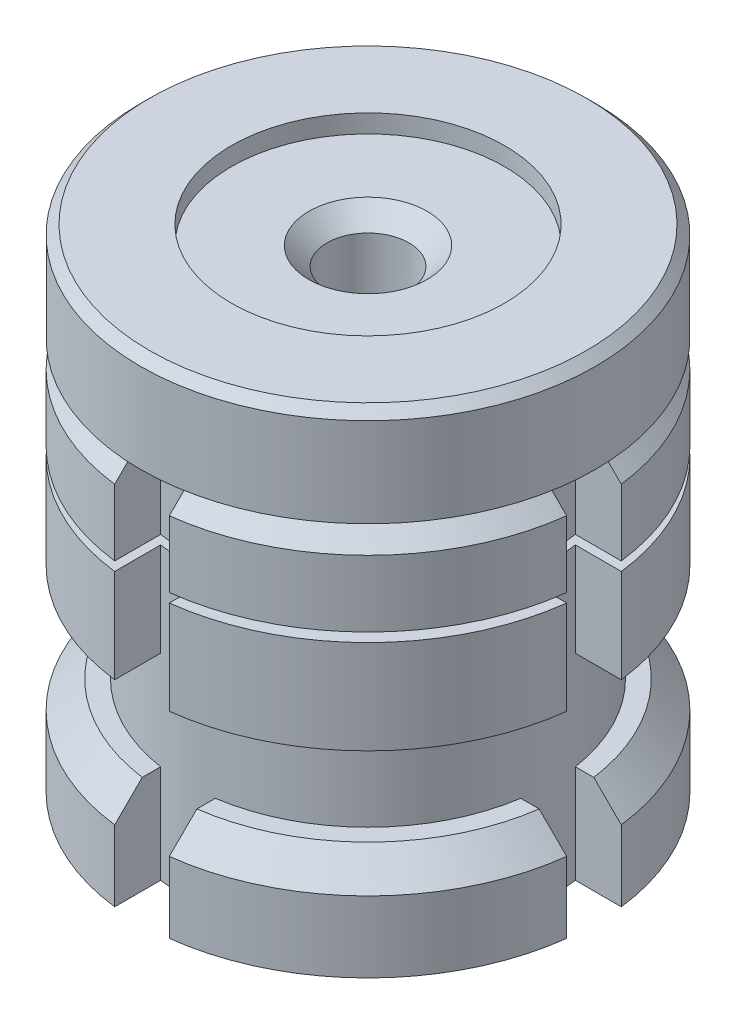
ISO-10303-21;
HEADER;
FILE_DESCRIPTION(('STEP AP214'),'2;1');
FILE_NAME('part.step','',(''),(''),'','','');
FILE_SCHEMA(('AUTOMOTIVE_DESIGN { 1 0 10303 214 1 1 1 1 }'));
ENDSEC;
DATA;
#1=APPLICATION_CONTEXT('core data for automotive mechanical design processes');
#2=APPLICATION_PROTOCOL_DEFINITION('international standard','automotive_design',2000,#1);
#3=PRODUCT_CONTEXT('',#1,'mechanical');
#4=PRODUCT('Part','Part','',(#3));
#5=PRODUCT_RELATED_PRODUCT_CATEGORY('part','',(#4));
#6=PRODUCT_DEFINITION_FORMATION('','',#4);
#7=PRODUCT_DEFINITION_CONTEXT('part definition',#1,'design');
#8=PRODUCT_DEFINITION('design','',#6,#7);
#9=PRODUCT_DEFINITION_SHAPE('','',#8);
#10=(LENGTH_UNIT() NAMED_UNIT(*) SI_UNIT(.MILLI.,.METRE.));
#11=(NAMED_UNIT(*) PLANE_ANGLE_UNIT() SI_UNIT($,.RADIAN.));
#12=(NAMED_UNIT(*) SI_UNIT($,.STERADIAN.) SOLID_ANGLE_UNIT());
#13=UNCERTAINTY_MEASURE_WITH_UNIT(LENGTH_MEASURE(1.E-05),#10,'distance_accuracy_value','');
#14=(GEOMETRIC_REPRESENTATION_CONTEXT(3) GLOBAL_UNCERTAINTY_ASSIGNED_CONTEXT((#13)) GLOBAL_UNIT_ASSIGNED_CONTEXT((#10,
#11,#12)) REPRESENTATION_CONTEXT('',''));
#15=CARTESIAN_POINT('',(0.,0.,0.));
#16=DIRECTION('',(0.,0.,1.));
#17=DIRECTION('',(1.,0.,0.));
#18=AXIS2_PLACEMENT_3D('',#15,#16,#17);
#19=CARTESIAN_POINT('',(0.,10.8,0.));
#20=DIRECTION('',(0.,-1.,0.));
#21=DIRECTION('',(0.,0.,-1.));
#22=AXIS2_PLACEMENT_3D('',#19,#20,#21);
#23=CYLINDRICAL_SURFACE('',#22,12.5);
#24=DIRECTION('',(0.,1.,0.));
#25=VECTOR('',#24,1.);
#26=CARTESIAN_POINT('',(-1.50000000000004,-14.7785048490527,12.4096736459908));
#27=LINE('',#26,#25);
#28=CARTESIAN_POINT('',(-1.50000000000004,5.65,12.4096736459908));
#29=VERTEX_POINT('',#28);
#30=CARTESIAN_POINT('',(-1.50000000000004,9.3,12.4096736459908));
#31=VERTEX_POINT('',#30);
#32=EDGE_CURVE('E1107',#29,#31,#27,.T.);
#33=ORIENTED_EDGE('',*,*,#32,.T.);
#34=CARTESIAN_POINT('',(0.,9.3,0.));
#35=DIRECTION('',(0.,1.,0.));
#36=DIRECTION('',(0.,0.,1.));
#37=AXIS2_PLACEMENT_3D('',#34,#35,#36);
#38=CIRCLE('',#37,12.5);
#39=CARTESIAN_POINT('',(-12.4096736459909,9.3,1.5));
#40=VERTEX_POINT('',#39);
#41=EDGE_CURVE('E55',#31,#40,#38,.F.);
#42=ORIENTED_EDGE('',*,*,#41,.T.);
#43=DIRECTION('',(0.,1.,0.));
#44=VECTOR('',#43,1.);
#45=CARTESIAN_POINT('',(-12.4096736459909,-14.7785048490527,1.5));
#46=LINE('',#45,#44);
#47=CARTESIAN_POINT('',(-12.4096736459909,5.65,1.5));
#48=VERTEX_POINT('',#47);
#49=EDGE_CURVE('E867',#48,#40,#46,.T.);
#50=ORIENTED_EDGE('',*,*,#49,.F.);
#51=CARTESIAN_POINT('',(0.,5.65,0.));
#52=DIRECTION('',(0.,1.,0.));
#53=DIRECTION('',(0.,0.,1.));
#54=AXIS2_PLACEMENT_3D('',#51,#52,#53);
#55=CIRCLE('',#54,12.5);
#56=EDGE_CURVE('E588',#48,#29,#55,.T.);
#57=ORIENTED_EDGE('',*,*,#56,.T.);
#58=EDGE_LOOP('',(#33,#42,#50,#57));
#59=FACE_BOUND('',#58,.T.);
#60=ADVANCED_FACE('F39',(#59),#23,.T.);
#61=DIRECTION('',(0.,1.,0.));
#62=VECTOR('',#61,1.);
#63=CARTESIAN_POINT('',(-12.4096736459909,-14.7785048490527,-1.5));
#64=LINE('',#63,#62);
#65=CARTESIAN_POINT('',(-12.4096736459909,5.65,-1.5));
#66=VERTEX_POINT('',#65);
#67=CARTESIAN_POINT('',(-12.4096736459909,9.30000000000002,-1.5));
#68=VERTEX_POINT('',#67);
#69=EDGE_CURVE('E883',#66,#68,#64,.T.);
#70=ORIENTED_EDGE('',*,*,#69,.T.);
#71=CARTESIAN_POINT('',(0.,9.30000000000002,0.));
#72=DIRECTION('',(0.,1.,0.));
#73=DIRECTION('',(0.,0.,1.));
#74=AXIS2_PLACEMENT_3D('',#71,#72,#73);
#75=CIRCLE('',#74,12.5);
#76=CARTESIAN_POINT('',(-1.50000000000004,9.30000000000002,-12.4096736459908));
#77=VERTEX_POINT('',#76);
#78=EDGE_CURVE('E646',#68,#77,#75,.F.);
#79=ORIENTED_EDGE('',*,*,#78,.T.);
#80=DIRECTION('',(0.,1.,0.));
#81=VECTOR('',#80,1.);
#82=CARTESIAN_POINT('',(-1.50000000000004,-14.7785048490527,-12.4096736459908));
#83=LINE('',#82,#81);
#84=CARTESIAN_POINT('',(-1.50000000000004,5.65,-12.4096736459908));
#85=VERTEX_POINT('',#84);
#86=EDGE_CURVE('E463',#85,#77,#83,.T.);
#87=ORIENTED_EDGE('',*,*,#86,.F.);
#88=EDGE_CURVE('E1226',#85,#66,#55,.T.);
#89=ORIENTED_EDGE('',*,*,#88,.T.);
#90=EDGE_LOOP('',(#70,#79,#87,#89));
#91=FACE_BOUND('',#90,.T.);
#92=ADVANCED_FACE('F1239',(#91),#23,.T.);
#93=DIRECTION('',(0.,1.,0.));
#94=VECTOR('',#93,1.);
#95=CARTESIAN_POINT('',(12.4096736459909,-14.7785048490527,1.50000000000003));
#96=LINE('',#95,#94);
#97=CARTESIAN_POINT('',(12.4096736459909,5.65,1.50000000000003));
#98=VERTEX_POINT('',#97);
#99=CARTESIAN_POINT('',(12.4096736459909,9.30000000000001,1.50000000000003));
#100=VERTEX_POINT('',#99);
#101=EDGE_CURVE('E1017',#98,#100,#96,.T.);
#102=ORIENTED_EDGE('',*,*,#101,.T.);
#103=CARTESIAN_POINT('',(0.,9.30000000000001,0.));
#104=DIRECTION('',(0.,1.,0.));
#105=DIRECTION('',(0.,0.,1.));
#106=AXIS2_PLACEMENT_3D('',#103,#104,#105);
#107=CIRCLE('',#106,12.5);
#108=CARTESIAN_POINT('',(1.50000000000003,9.30000000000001,12.4096736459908));
#109=VERTEX_POINT('',#108);
#110=EDGE_CURVE('E728',#100,#109,#107,.F.);
#111=ORIENTED_EDGE('',*,*,#110,.T.);
#112=DIRECTION('',(0.,1.,0.));
#113=VECTOR('',#112,1.);
#114=CARTESIAN_POINT('',(1.50000000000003,-14.7785048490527,12.4096736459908));
#115=LINE('',#114,#113);
#116=CARTESIAN_POINT('',(1.50000000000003,5.65,12.4096736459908));
#117=VERTEX_POINT('',#116);
#118=EDGE_CURVE('E1097',#117,#109,#115,.T.);
#119=ORIENTED_EDGE('',*,*,#118,.F.);
#120=EDGE_CURVE('E589',#117,#98,#55,.T.);
#121=ORIENTED_EDGE('',*,*,#120,.T.);
#122=EDGE_LOOP('',(#102,#111,#119,#121));
#123=FACE_BOUND('',#122,.T.);
#124=ADVANCED_FACE('F1095',(#123),#23,.T.);
#125=CARTESIAN_POINT('',(0.,5.65,12.5));
#126=DIRECTION('',(0.,1.,0.));
#127=DIRECTION('',(0.,0.,1.));
#128=AXIS2_PLACEMENT_3D('',#125,#126,#127);
#129=PLANE('',#128);
#130=CARTESIAN_POINT('',(0.,5.65,0.));
#131=DIRECTION('',(0.,1.,0.));
#132=DIRECTION('',(0.,0.,1.));
#133=AXIS2_PLACEMENT_3D('',#130,#131,#132);
#134=CIRCLE('',#133,7.5);
#135=CARTESIAN_POINT('',(0.,5.65,7.5));
#136=VERTEX_POINT('',#135);
#137=EDGE_CURVE('E593',#136,#136,#134,.T.);
#138=ORIENTED_EDGE('',*,*,#137,.T.);
#139=EDGE_LOOP('',(#138));
#140=FACE_BOUND('',#139,.T.);
#141=ORIENTED_EDGE('',*,*,#56,.F.);
#142=DIRECTION('',(1.,0.,0.));
#143=VECTOR('',#142,1.);
#144=CARTESIAN_POINT('',(0.,5.65,1.5));
#145=LINE('',#144,#143);
#146=CARTESIAN_POINT('',(-9.8868599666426,5.65,1.49999999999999));
#147=VERTEX_POINT('',#146);
#148=EDGE_CURVE('E563',#48,#147,#145,.T.);
#149=ORIENTED_EDGE('',*,*,#148,.T.);
#150=CARTESIAN_POINT('',(0.,5.65,0.));
#151=DIRECTION('',(0.,1.,0.));
#152=DIRECTION('',(0.,0.,1.));
#153=AXIS2_PLACEMENT_3D('',#150,#151,#152);
#154=CIRCLE('',#153,10.);
#155=CARTESIAN_POINT('',(-9.88685996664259,5.65,-1.5));
#156=VERTEX_POINT('',#155);
#157=EDGE_CURVE('E547',#147,#156,#154,.F.);
#158=ORIENTED_EDGE('',*,*,#157,.T.);
#159=DIRECTION('',(-1.,0.,0.));
#160=VECTOR('',#159,1.);
#161=CARTESIAN_POINT('',(0.,5.65,-1.5));
#162=LINE('',#161,#160);
#163=EDGE_CURVE('E540',#156,#66,#162,.T.);
#164=ORIENTED_EDGE('',*,*,#163,.T.);
#165=ORIENTED_EDGE('',*,*,#88,.F.);
#166=DIRECTION('',(0.,0.,1.));
#167=VECTOR('',#166,1.);
#168=CARTESIAN_POINT('',(-1.50000000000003,5.65,12.5));
#169=LINE('',#168,#167);
#170=CARTESIAN_POINT('',(-1.50000000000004,5.65,-9.88685996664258));
#171=VERTEX_POINT('',#170);
#172=EDGE_CURVE('E526',#85,#171,#169,.T.);
#173=ORIENTED_EDGE('',*,*,#172,.T.);
#174=CARTESIAN_POINT('',(0.,5.65,0.));
#175=DIRECTION('',(0.,1.,0.));
#176=DIRECTION('',(0.,0.,1.));
#177=AXIS2_PLACEMENT_3D('',#174,#175,#176);
#178=CIRCLE('',#177,9.99999999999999);
#179=CARTESIAN_POINT('',(1.50000000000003,5.65,-9.88685996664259));
#180=VERTEX_POINT('',#179);
#181=EDGE_CURVE('E422',#171,#180,#178,.F.);
#182=ORIENTED_EDGE('',*,*,#181,.T.);
#183=DIRECTION('',(0.,0.,-1.));
#184=VECTOR('',#183,1.);
#185=CARTESIAN_POINT('',(1.50000000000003,5.65,12.5));
#186=LINE('',#185,#184);
#187=CARTESIAN_POINT('',(1.50000000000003,5.65,-12.4096736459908));
#188=VERTEX_POINT('',#187);
#189=EDGE_CURVE('E499',#180,#188,#186,.T.);
#190=ORIENTED_EDGE('',*,*,#189,.T.);
#191=CARTESIAN_POINT('',(12.4096736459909,5.65,-1.5));
#192=VERTEX_POINT('',#191);
#193=EDGE_CURVE('E594',#192,#188,#55,.T.);
#194=ORIENTED_EDGE('',*,*,#193,.F.);
#195=DIRECTION('',(-1.,0.,0.));
#196=VECTOR('',#195,1.);
#197=CARTESIAN_POINT('',(0.,5.65,-1.5));
#198=LINE('',#197,#196);
#199=CARTESIAN_POINT('',(9.88685996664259,5.65,-1.5));
#200=VERTEX_POINT('',#199);
#201=EDGE_CURVE('E1062',#192,#200,#198,.T.);
#202=ORIENTED_EDGE('',*,*,#201,.T.);
#203=CARTESIAN_POINT('',(0.,5.65,0.));
#204=DIRECTION('',(0.,1.,0.));
#205=DIRECTION('',(0.,0.,1.));
#206=AXIS2_PLACEMENT_3D('',#203,#204,#205);
#207=CIRCLE('',#206,10.);
#208=CARTESIAN_POINT('',(9.88685996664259,5.65,1.50000000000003));
#209=VERTEX_POINT('',#208);
#210=EDGE_CURVE('E1060',#200,#209,#207,.F.);
#211=ORIENTED_EDGE('',*,*,#210,.T.);
#212=DIRECTION('',(1.,0.,0.));
#213=VECTOR('',#212,1.);
#214=CARTESIAN_POINT('',(0.,5.65,1.50000000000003));
#215=LINE('',#214,#213);
#216=EDGE_CURVE('E987',#209,#98,#215,.T.);
#217=ORIENTED_EDGE('',*,*,#216,.T.);
#218=ORIENTED_EDGE('',*,*,#120,.F.);
#219=DIRECTION('',(0.,0.,-1.));
#220=VECTOR('',#219,1.);
#221=CARTESIAN_POINT('',(1.50000000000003,5.65,12.5));
#222=LINE('',#221,#220);
#223=CARTESIAN_POINT('',(1.50000000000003,5.65,9.88685996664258));
#224=VERTEX_POINT('',#223);
#225=EDGE_CURVE('E848',#117,#224,#222,.T.);
#226=ORIENTED_EDGE('',*,*,#225,.T.);
#227=CARTESIAN_POINT('',(0.,5.65,0.));
#228=DIRECTION('',(0.,1.,0.));
#229=DIRECTION('',(0.,0.,1.));
#230=AXIS2_PLACEMENT_3D('',#227,#228,#229);
#231=CIRCLE('',#230,10.);
#232=CARTESIAN_POINT('',(-1.50000000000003,5.65,9.88685996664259));
#233=VERTEX_POINT('',#232);
#234=EDGE_CURVE('E871',#224,#233,#231,.F.);
#235=ORIENTED_EDGE('',*,*,#234,.T.);
#236=DIRECTION('',(0.,0.,1.));
#237=VECTOR('',#236,1.);
#238=CARTESIAN_POINT('',(-1.50000000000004,5.65,12.5));
#239=LINE('',#238,#237);
#240=EDGE_CURVE('E1152',#233,#29,#239,.T.);
#241=ORIENTED_EDGE('',*,*,#240,.T.);
#242=EDGE_LOOP('',(#141,#149,#158,#164,#165,#173,#182,#190,#194,#202,#211,#217,#218,#226,#235,#241));
#243=FACE_BOUND('',#242,.T.);
#244=ADVANCED_FACE('F1066',(#140,#243),#129,.F.);
#245=CARTESIAN_POINT('',(0.,5.15,12.5));
#246=DIRECTION('',(0.,-1.,0.));
#247=DIRECTION('',(0.,0.,-1.));
#248=AXIS2_PLACEMENT_3D('',#245,#246,#247);
#249=PLANE('',#248);
#250=CARTESIAN_POINT('',(0.,5.15,0.));
#251=DIRECTION('',(0.,1.,0.));
#252=DIRECTION('',(0.,0.,1.));
#253=AXIS2_PLACEMENT_3D('',#250,#251,#252);
#254=CIRCLE('',#253,7.5);
#255=CARTESIAN_POINT('',(0.,5.15,7.5));
#256=VERTEX_POINT('',#255);
#257=EDGE_CURVE('E572',#256,#256,#254,.T.);
#258=ORIENTED_EDGE('',*,*,#257,.F.);
#259=EDGE_LOOP('',(#258));
#260=FACE_BOUND('',#259,.T.);
#261=CARTESIAN_POINT('',(0.,5.15,0.));
#262=DIRECTION('',(0.,-1.,0.));
#263=DIRECTION('',(0.,0.,-1.));
#264=AXIS2_PLACEMENT_3D('',#261,#262,#263);
#265=CIRCLE('',#264,10.);
#266=CARTESIAN_POINT('',(-9.88685996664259,5.15,-1.5));
#267=VERTEX_POINT('',#266);
#268=CARTESIAN_POINT('',(-9.8868599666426,5.15,1.49999999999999));
#269=VERTEX_POINT('',#268);
#270=EDGE_CURVE('E544',#267,#269,#265,.F.);
#271=ORIENTED_EDGE('',*,*,#270,.T.);
#272=DIRECTION('',(-1.,0.,0.));
#273=VECTOR('',#272,1.);
#274=CARTESIAN_POINT('',(0.,5.15,1.5));
#275=LINE('',#274,#273);
#276=CARTESIAN_POINT('',(-12.4096736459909,5.15,1.5));
#277=VERTEX_POINT('',#276);
#278=EDGE_CURVE('E559',#269,#277,#275,.T.);
#279=ORIENTED_EDGE('',*,*,#278,.T.);
#280=CARTESIAN_POINT('',(0.,5.15,0.));
#281=DIRECTION('',(0.,1.,0.));
#282=DIRECTION('',(0.,0.,1.));
#283=AXIS2_PLACEMENT_3D('',#280,#281,#282);
#284=CIRCLE('',#283,12.5);
#285=CARTESIAN_POINT('',(-1.50000000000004,5.15,12.4096736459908));
#286=VERTEX_POINT('',#285);
#287=EDGE_CURVE('E583',#277,#286,#284,.T.);
#288=ORIENTED_EDGE('',*,*,#287,.T.);
#289=DIRECTION('',(0.,0.,-1.));
#290=VECTOR('',#289,1.);
#291=CARTESIAN_POINT('',(-1.50000000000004,5.15,12.5));
#292=LINE('',#291,#290);
#293=CARTESIAN_POINT('',(-1.50000000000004,5.15,9.88685996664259));
#294=VERTEX_POINT('',#293);
#295=EDGE_CURVE('E1147',#286,#294,#292,.T.);
#296=ORIENTED_EDGE('',*,*,#295,.T.);
#297=CARTESIAN_POINT('',(0.,5.15,0.));
#298=DIRECTION('',(0.,-1.,0.));
#299=DIRECTION('',(0.,0.,-1.));
#300=AXIS2_PLACEMENT_3D('',#297,#298,#299);
#301=CIRCLE('',#300,10.);
#302=CARTESIAN_POINT('',(1.50000000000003,5.15,9.88685996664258));
#303=VERTEX_POINT('',#302);
#304=EDGE_CURVE('E864',#294,#303,#301,.F.);
#305=ORIENTED_EDGE('',*,*,#304,.T.);
#306=DIRECTION('',(0.,0.,1.));
#307=VECTOR('',#306,1.);
#308=CARTESIAN_POINT('',(1.50000000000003,5.15,12.5));
#309=LINE('',#308,#307);
#310=CARTESIAN_POINT('',(1.50000000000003,5.15,12.4096736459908));
#311=VERTEX_POINT('',#310);
#312=EDGE_CURVE('E1144',#303,#311,#309,.T.);
#313=ORIENTED_EDGE('',*,*,#312,.T.);
#314=CARTESIAN_POINT('',(12.4096736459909,5.15,1.50000000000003));
#315=VERTEX_POINT('',#314);
#316=EDGE_CURVE('E584',#311,#315,#284,.T.);
#317=ORIENTED_EDGE('',*,*,#316,.T.);
#318=DIRECTION('',(-1.,0.,0.));
#319=VECTOR('',#318,1.);
#320=CARTESIAN_POINT('',(0.,5.15,1.50000000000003));
#321=LINE('',#320,#319);
#322=CARTESIAN_POINT('',(9.88685996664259,5.15,1.50000000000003));
#323=VERTEX_POINT('',#322);
#324=EDGE_CURVE('E1085',#315,#323,#321,.T.);
#325=ORIENTED_EDGE('',*,*,#324,.T.);
#326=CARTESIAN_POINT('',(0.,5.15,0.));
#327=DIRECTION('',(0.,-1.,0.));
#328=DIRECTION('',(0.,0.,-1.));
#329=AXIS2_PLACEMENT_3D('',#326,#327,#328);
#330=CIRCLE('',#329,10.);
#331=CARTESIAN_POINT('',(9.88685996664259,5.15,-1.5));
#332=VERTEX_POINT('',#331);
#333=EDGE_CURVE('E1156',#323,#332,#330,.F.);
#334=ORIENTED_EDGE('',*,*,#333,.T.);
#335=DIRECTION('',(1.,0.,0.));
#336=VECTOR('',#335,1.);
#337=CARTESIAN_POINT('',(0.,5.15,-1.5));
#338=LINE('',#337,#336);
#339=CARTESIAN_POINT('',(12.4096736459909,5.15,-1.5));
#340=VERTEX_POINT('',#339);
#341=EDGE_CURVE('E1071',#332,#340,#338,.T.);
#342=ORIENTED_EDGE('',*,*,#341,.T.);
#343=CARTESIAN_POINT('',(1.50000000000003,5.15,-12.4096736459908));
#344=VERTEX_POINT('',#343);
#345=EDGE_CURVE('E497',#340,#344,#284,.T.);
#346=ORIENTED_EDGE('',*,*,#345,.T.);
#347=DIRECTION('',(0.,0.,1.));
#348=VECTOR('',#347,1.);
#349=CARTESIAN_POINT('',(1.50000000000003,5.15,12.5));
#350=LINE('',#349,#348);
#351=CARTESIAN_POINT('',(1.50000000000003,5.15,-9.88685996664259));
#352=VERTEX_POINT('',#351);
#353=EDGE_CURVE('E481',#344,#352,#350,.T.);
#354=ORIENTED_EDGE('',*,*,#353,.T.);
#355=CARTESIAN_POINT('',(0.,5.15,0.));
#356=DIRECTION('',(0.,-1.,0.));
#357=DIRECTION('',(0.,0.,-1.));
#358=AXIS2_PLACEMENT_3D('',#355,#356,#357);
#359=CIRCLE('',#358,9.99999999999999);
#360=CARTESIAN_POINT('',(-1.50000000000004,5.15,-9.88685996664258));
#361=VERTEX_POINT('',#360);
#362=EDGE_CURVE('E494',#352,#361,#359,.F.);
#363=ORIENTED_EDGE('',*,*,#362,.T.);
#364=DIRECTION('',(0.,0.,-1.));
#365=VECTOR('',#364,1.);
#366=CARTESIAN_POINT('',(-1.50000000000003,5.15,12.5));
#367=LINE('',#366,#365);
#368=CARTESIAN_POINT('',(-1.50000000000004,5.15,-12.4096736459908));
#369=VERTEX_POINT('',#368);
#370=EDGE_CURVE('E523',#361,#369,#367,.T.);
#371=ORIENTED_EDGE('',*,*,#370,.T.);
#372=CARTESIAN_POINT('',(-12.4096736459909,5.15,-1.5));
#373=VERTEX_POINT('',#372);
#374=EDGE_CURVE('E1306',#369,#373,#284,.T.);
#375=ORIENTED_EDGE('',*,*,#374,.T.);
#376=DIRECTION('',(1.,0.,0.));
#377=VECTOR('',#376,1.);
#378=CARTESIAN_POINT('',(0.,5.15,-1.5));
#379=LINE('',#378,#377);
#380=EDGE_CURVE('E536',#373,#267,#379,.T.);
#381=ORIENTED_EDGE('',*,*,#380,.T.);
#382=EDGE_LOOP('',(#271,#279,#288,#296,#305,#313,#317,#325,#334,#342,#346,#354,#363,#371,#375,#381));
#383=FACE_BOUND('',#382,.T.);
#384=ADVANCED_FACE('F492',(#260,#383),#249,.F.);
#385=CARTESIAN_POINT('',(0.,0.,0.));
#386=DIRECTION('',(0.,1.,0.));
#387=DIRECTION('',(0.,0.,1.));
#388=AXIS2_PLACEMENT_3D('',#385,#386,#387);
#389=PLANE('',#388);
#390=CARTESIAN_POINT('',(0.,0.,0.));
#391=DIRECTION('',(0.,1.,0.));
#392=DIRECTION('',(0.,0.,1.));
#393=AXIS2_PLACEMENT_3D('',#390,#391,#392);
#394=CIRCLE('',#393,12.5);
#395=CARTESIAN_POINT('',(-12.4096736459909,0.,1.5));
#396=VERTEX_POINT('',#395);
#397=CARTESIAN_POINT('',(-1.50000000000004,0.,12.4096736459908));
#398=VERTEX_POINT('',#397);
#399=EDGE_CURVE('E598',#396,#398,#394,.T.);
#400=ORIENTED_EDGE('',*,*,#399,.F.);
#401=DIRECTION('',(1.,0.,0.));
#402=VECTOR('',#401,1.);
#403=CARTESIAN_POINT('',(0.,0.,1.5));
#404=LINE('',#403,#402);
#405=CARTESIAN_POINT('',(-9.8868599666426,0.,1.49999999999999));
#406=VERTEX_POINT('',#405);
#407=EDGE_CURVE('E555',#396,#406,#404,.T.);
#408=ORIENTED_EDGE('',*,*,#407,.T.);
#409=CARTESIAN_POINT('',(0.,0.,0.));
#410=DIRECTION('',(0.,-1.,0.));
#411=DIRECTION('',(0.,0.,-1.));
#412=AXIS2_PLACEMENT_3D('',#409,#410,#411);
#413=CIRCLE('',#412,10.);
#414=CARTESIAN_POINT('',(-1.50000000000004,0.,9.88685996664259));
#415=VERTEX_POINT('',#414);
#416=EDGE_CURVE('E1292',#415,#406,#413,.T.);
#417=ORIENTED_EDGE('',*,*,#416,.F.);
#418=DIRECTION('',(0.,0.,1.));
#419=VECTOR('',#418,1.);
#420=CARTESIAN_POINT('',(-1.50000000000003,0.,0.));
#421=LINE('',#420,#419);
#422=EDGE_CURVE('E847',#415,#398,#421,.T.);
#423=ORIENTED_EDGE('',*,*,#422,.T.);
#424=EDGE_LOOP('',(#400,#408,#417,#423));
#425=FACE_BOUND('',#424,.T.);
#426=ADVANCED_FACE('F1254',(#425),#389,.F.);
#427=CARTESIAN_POINT('',(-9.88685996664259,0.,-1.5));
#428=VERTEX_POINT('',#427);
#429=CARTESIAN_POINT('',(-1.50000000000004,0.,-9.88685996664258));
#430=VERTEX_POINT('',#429);
#431=EDGE_CURVE('E579',#428,#430,#413,.T.);
#432=ORIENTED_EDGE('',*,*,#431,.F.);
#433=DIRECTION('',(-1.,0.,0.));
#434=VECTOR('',#433,1.);
#435=CARTESIAN_POINT('',(0.,0.,-1.5));
#436=LINE('',#435,#434);
#437=CARTESIAN_POINT('',(-12.4096736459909,0.,-1.5));
#438=VERTEX_POINT('',#437);
#439=EDGE_CURVE('E532',#428,#438,#436,.T.);
#440=ORIENTED_EDGE('',*,*,#439,.T.);
#441=CARTESIAN_POINT('',(-1.50000000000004,0.,-12.4096736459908));
#442=VERTEX_POINT('',#441);
#443=EDGE_CURVE('E1280',#442,#438,#394,.T.);
#444=ORIENTED_EDGE('',*,*,#443,.F.);
#445=DIRECTION('',(0.,0.,1.));
#446=VECTOR('',#445,1.);
#447=CARTESIAN_POINT('',(-1.50000000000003,0.,0.));
#448=LINE('',#447,#446);
#449=EDGE_CURVE('E519',#442,#430,#448,.T.);
#450=ORIENTED_EDGE('',*,*,#449,.T.);
#451=EDGE_LOOP('',(#432,#440,#444,#450));
#452=FACE_BOUND('',#451,.T.);
#453=ADVANCED_FACE('F1304',(#452),#389,.F.);
#454=CARTESIAN_POINT('',(9.88685996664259,0.,1.50000000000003));
#455=VERTEX_POINT('',#454);
#456=CARTESIAN_POINT('',(1.50000000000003,0.,9.88685996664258));
#457=VERTEX_POINT('',#456);
#458=EDGE_CURVE('E578',#455,#457,#413,.T.);
#459=ORIENTED_EDGE('',*,*,#458,.F.);
#460=DIRECTION('',(1.,0.,0.));
#461=VECTOR('',#460,1.);
#462=CARTESIAN_POINT('',(0.,0.,1.50000000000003));
#463=LINE('',#462,#461);
#464=CARTESIAN_POINT('',(12.4096736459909,0.,1.50000000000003));
#465=VERTEX_POINT('',#464);
#466=EDGE_CURVE('E1075',#455,#465,#463,.T.);
#467=ORIENTED_EDGE('',*,*,#466,.T.);
#468=CARTESIAN_POINT('',(1.50000000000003,0.,12.4096736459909));
#469=VERTEX_POINT('',#468);
#470=EDGE_CURVE('E599',#469,#465,#394,.T.);
#471=ORIENTED_EDGE('',*,*,#470,.F.);
#472=DIRECTION('',(0.,0.,-1.));
#473=VECTOR('',#472,1.);
#474=CARTESIAN_POINT('',(1.50000000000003,0.,0.));
#475=LINE('',#474,#473);
#476=EDGE_CURVE('E1185',#469,#457,#475,.T.);
#477=ORIENTED_EDGE('',*,*,#476,.T.);
#478=EDGE_LOOP('',(#459,#467,#471,#477));
#479=FACE_BOUND('',#478,.T.);
#480=ADVANCED_FACE('F1184',(#479),#389,.F.);
#481=ORIENTED_EDGE('',*,*,#287,.F.);
#482=EDGE_CURVE('E865',#396,#277,#46,.T.);
#483=ORIENTED_EDGE('',*,*,#482,.F.);
#484=ORIENTED_EDGE('',*,*,#399,.T.);
#485=EDGE_CURVE('E1105',#398,#286,#27,.T.);
#486=ORIENTED_EDGE('',*,*,#485,.T.);
#487=EDGE_LOOP('',(#481,#483,#484,#486));
#488=FACE_BOUND('',#487,.T.);
#489=ADVANCED_FACE('F1271',(#488),#23,.T.);
#490=ORIENTED_EDGE('',*,*,#443,.T.);
#491=EDGE_CURVE('E881',#438,#373,#64,.T.);
#492=ORIENTED_EDGE('',*,*,#491,.T.);
#493=ORIENTED_EDGE('',*,*,#374,.F.);
#494=EDGE_CURVE('E948',#442,#369,#83,.T.);
#495=ORIENTED_EDGE('',*,*,#494,.F.);
#496=EDGE_LOOP('',(#490,#492,#493,#495));
#497=FACE_BOUND('',#496,.T.);
#498=ADVANCED_FACE('F1265',(#497),#23,.T.);
#499=ORIENTED_EDGE('',*,*,#470,.T.);
#500=EDGE_CURVE('E1016',#465,#315,#96,.T.);
#501=ORIENTED_EDGE('',*,*,#500,.T.);
#502=ORIENTED_EDGE('',*,*,#316,.F.);
#503=EDGE_CURVE('E1099',#469,#311,#115,.T.);
#504=ORIENTED_EDGE('',*,*,#503,.F.);
#505=EDGE_LOOP('',(#499,#501,#502,#504));
#506=FACE_BOUND('',#505,.T.);
#507=ADVANCED_FACE('F1180',(#506),#23,.T.);
#508=CARTESIAN_POINT('',(0.,-5.4,0.));
#509=DIRECTION('',(0.,-1.,0.));
#510=DIRECTION('',(0.,0.,-1.));
#511=AXIS2_PLACEMENT_3D('',#508,#509,#510);
#512=CYLINDRICAL_SURFACE('',#511,12.5);
#513=CARTESIAN_POINT('',(-1.50000000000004,-10.8,12.4096736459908));
#514=VERTEX_POINT('',#513);
#515=CARTESIAN_POINT('',(-1.50000000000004,-6.90000000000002,12.4096736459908));
#516=VERTEX_POINT('',#515);
#517=EDGE_CURVE('E858',#514,#516,#27,.T.);
#518=ORIENTED_EDGE('',*,*,#517,.T.);
#519=CARTESIAN_POINT('',(0.,-6.90000000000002,0.));
#520=DIRECTION('',(0.,-1.,0.));
#521=DIRECTION('',(0.,0.,-1.));
#522=AXIS2_PLACEMENT_3D('',#519,#520,#521);
#523=CIRCLE('',#522,12.5);
#524=CARTESIAN_POINT('',(-12.4096736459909,-6.90000000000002,1.5));
#525=VERTEX_POINT('',#524);
#526=EDGE_CURVE('E776',#516,#525,#523,.T.);
#527=ORIENTED_EDGE('',*,*,#526,.T.);
#528=CARTESIAN_POINT('',(-12.4096736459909,-10.8,1.5));
#529=VERTEX_POINT('',#528);
#530=EDGE_CURVE('E856',#529,#525,#46,.T.);
#531=ORIENTED_EDGE('',*,*,#530,.F.);
#532=CARTESIAN_POINT('',(0.,-10.8,0.));
#533=DIRECTION('',(0.,-1.,0.));
#534=DIRECTION('',(0.,0.,-1.));
#535=AXIS2_PLACEMENT_3D('',#532,#533,#534);
#536=CIRCLE('',#535,12.5);
#537=EDGE_CURVE('E1318',#514,#529,#536,.T.);
#538=ORIENTED_EDGE('',*,*,#537,.F.);
#539=EDGE_LOOP('',(#518,#527,#531,#538));
#540=FACE_BOUND('',#539,.T.);
#541=ADVANCED_FACE('F854',(#540),#512,.T.);
#542=CARTESIAN_POINT('',(-12.4096736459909,-10.8,-1.5));
#543=VERTEX_POINT('',#542);
#544=CARTESIAN_POINT('',(-12.4096736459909,-6.90000000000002,-1.5));
#545=VERTEX_POINT('',#544);
#546=EDGE_CURVE('E877',#543,#545,#64,.T.);
#547=ORIENTED_EDGE('',*,*,#546,.T.);
#548=CARTESIAN_POINT('',(0.,-6.90000000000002,0.));
#549=DIRECTION('',(0.,-1.,0.));
#550=DIRECTION('',(0.,0.,-1.));
#551=AXIS2_PLACEMENT_3D('',#548,#549,#550);
#552=CIRCLE('',#551,12.5);
#553=CARTESIAN_POINT('',(-1.50000000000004,-6.90000000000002,-12.4096736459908));
#554=VERTEX_POINT('',#553);
#555=EDGE_CURVE('E608',#545,#554,#552,.T.);
#556=ORIENTED_EDGE('',*,*,#555,.T.);
#557=CARTESIAN_POINT('',(-1.50000000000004,-10.8,-12.4096736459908));
#558=VERTEX_POINT('',#557);
#559=EDGE_CURVE('E943',#558,#554,#83,.T.);
#560=ORIENTED_EDGE('',*,*,#559,.F.);
#561=EDGE_CURVE('E567',#543,#558,#536,.T.);
#562=ORIENTED_EDGE('',*,*,#561,.F.);
#563=EDGE_LOOP('',(#547,#556,#560,#562));
#564=FACE_BOUND('',#563,.T.);
#565=ADVANCED_FACE('F1270',(#564),#512,.T.);
#566=CARTESIAN_POINT('',(12.4096736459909,-10.8,1.50000000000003));
#567=VERTEX_POINT('',#566);
#568=CARTESIAN_POINT('',(12.4096736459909,-6.90000000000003,1.50000000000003));
#569=VERTEX_POINT('',#568);
#570=EDGE_CURVE('E1010',#567,#569,#96,.T.);
#571=ORIENTED_EDGE('',*,*,#570,.T.);
#572=CARTESIAN_POINT('',(0.,-6.90000000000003,0.));
#573=DIRECTION('',(0.,-1.,0.));
#574=DIRECTION('',(0.,0.,-1.));
#575=AXIS2_PLACEMENT_3D('',#572,#573,#574);
#576=CIRCLE('',#575,12.5);
#577=CARTESIAN_POINT('',(1.50000000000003,-6.90000000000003,12.4096736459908));
#578=VERTEX_POINT('',#577);
#579=EDGE_CURVE('E747',#569,#578,#576,.T.);
#580=ORIENTED_EDGE('',*,*,#579,.T.);
#581=CARTESIAN_POINT('',(1.50000000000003,-10.8,12.4096736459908));
#582=VERTEX_POINT('',#581);
#583=EDGE_CURVE('E1101',#582,#578,#115,.T.);
#584=ORIENTED_EDGE('',*,*,#583,.F.);
#585=EDGE_CURVE('E573',#567,#582,#536,.T.);
#586=ORIENTED_EDGE('',*,*,#585,.F.);
#587=EDGE_LOOP('',(#571,#580,#584,#586));
#588=FACE_BOUND('',#587,.T.);
#589=ADVANCED_FACE('F1252',(#588),#512,.T.);
#590=CARTESIAN_POINT('',(0.,-5.4,0.));
#591=DIRECTION('',(0.,-1.,0.));
#592=DIRECTION('',(0.,0.,-1.));
#593=AXIS2_PLACEMENT_3D('',#590,#591,#592);
#594=PLANE('',#593);
#595=DIRECTION('',(-1.,0.,0.));
#596=VECTOR('',#595,1.);
#597=CARTESIAN_POINT('',(0.,-5.4,1.5));
#598=LINE('',#597,#596);
#599=CARTESIAN_POINT('',(-9.8868599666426,-5.4,1.49999999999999));
#600=VERTEX_POINT('',#599);
#601=CARTESIAN_POINT('',(-10.8972473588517,-5.4,1.5));
#602=VERTEX_POINT('',#601);
#603=EDGE_CURVE('E551',#600,#602,#598,.T.);
#604=ORIENTED_EDGE('',*,*,#603,.T.);
#605=CARTESIAN_POINT('',(0.,-5.4,0.));
#606=DIRECTION('',(0.,-1.,0.));
#607=DIRECTION('',(0.,0.,-1.));
#608=AXIS2_PLACEMENT_3D('',#605,#606,#607);
#609=CIRCLE('',#608,11.);
#610=CARTESIAN_POINT('',(-1.50000000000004,-5.4,10.8972473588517));
#611=VERTEX_POINT('',#610);
#612=EDGE_CURVE('E786',#602,#611,#609,.F.);
#613=ORIENTED_EDGE('',*,*,#612,.T.);
#614=DIRECTION('',(0.,0.,-1.));
#615=VECTOR('',#614,1.);
#616=CARTESIAN_POINT('',(-1.50000000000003,-5.4,0.));
#617=LINE('',#616,#615);
#618=CARTESIAN_POINT('',(-1.50000000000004,-5.4,9.88685996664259));
#619=VERTEX_POINT('',#618);
#620=EDGE_CURVE('E839',#611,#619,#617,.T.);
#621=ORIENTED_EDGE('',*,*,#620,.T.);
#622=CARTESIAN_POINT('',(0.,-5.4,0.));
#623=DIRECTION('',(0.,-1.,0.));
#624=DIRECTION('',(0.,0.,-1.));
#625=AXIS2_PLACEMENT_3D('',#622,#623,#624);
#626=CIRCLE('',#625,10.);
#627=EDGE_CURVE('E1329',#619,#600,#626,.T.);
#628=ORIENTED_EDGE('',*,*,#627,.T.);
#629=EDGE_LOOP('',(#604,#613,#621,#628));
#630=FACE_BOUND('',#629,.T.);
#631=ADVANCED_FACE('F837',(#630),#594,.F.);
#632=DIRECTION('',(0.,0.,-1.));
#633=VECTOR('',#632,1.);
#634=CARTESIAN_POINT('',(-1.50000000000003,-5.4,0.));
#635=LINE('',#634,#633);
#636=CARTESIAN_POINT('',(-1.50000000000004,-5.4,-9.88685996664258));
#637=VERTEX_POINT('',#636);
#638=CARTESIAN_POINT('',(-1.50000000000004,-5.4,-10.8972473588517));
#639=VERTEX_POINT('',#638);
#640=EDGE_CURVE('E515',#637,#639,#635,.T.);
#641=ORIENTED_EDGE('',*,*,#640,.T.);
#642=CARTESIAN_POINT('',(0.,-5.4,0.));
#643=DIRECTION('',(0.,-1.,0.));
#644=DIRECTION('',(0.,0.,-1.));
#645=AXIS2_PLACEMENT_3D('',#642,#643,#644);
#646=CIRCLE('',#645,11.);
#647=CARTESIAN_POINT('',(-10.8972473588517,-5.4,-1.5));
#648=VERTEX_POINT('',#647);
#649=EDGE_CURVE('E621',#639,#648,#646,.F.);
#650=ORIENTED_EDGE('',*,*,#649,.T.);
#651=DIRECTION('',(1.,0.,0.));
#652=VECTOR('',#651,1.);
#653=CARTESIAN_POINT('',(0.,-5.4,-1.5));
#654=LINE('',#653,#652);
#655=CARTESIAN_POINT('',(-9.88685996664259,-5.4,-1.5));
#656=VERTEX_POINT('',#655);
#657=EDGE_CURVE('E529',#648,#656,#654,.T.);
#658=ORIENTED_EDGE('',*,*,#657,.T.);
#659=EDGE_CURVE('E577',#656,#637,#626,.T.);
#660=ORIENTED_EDGE('',*,*,#659,.T.);
#661=EDGE_LOOP('',(#641,#650,#658,#660));
#662=FACE_BOUND('',#661,.T.);
#663=ADVANCED_FACE('F1325',(#662),#594,.F.);
#664=DIRECTION('',(0.,0.,1.));
#665=VECTOR('',#664,1.);
#666=CARTESIAN_POINT('',(1.50000000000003,-5.4,0.));
#667=LINE('',#666,#665);
#668=CARTESIAN_POINT('',(1.50000000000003,-5.4,9.88685996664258));
#669=VERTEX_POINT('',#668);
#670=CARTESIAN_POINT('',(1.50000000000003,-5.4,10.8972473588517));
#671=VERTEX_POINT('',#670);
#672=EDGE_CURVE('E1212',#669,#671,#667,.T.);
#673=ORIENTED_EDGE('',*,*,#672,.T.);
#674=CARTESIAN_POINT('',(0.,-5.4,0.));
#675=DIRECTION('',(0.,-1.,0.));
#676=DIRECTION('',(0.,0.,-1.));
#677=AXIS2_PLACEMENT_3D('',#674,#675,#676);
#678=CIRCLE('',#677,11.);
#679=CARTESIAN_POINT('',(10.8972473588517,-5.4,1.50000000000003));
#680=VERTEX_POINT('',#679);
#681=EDGE_CURVE('E767',#671,#680,#678,.F.);
#682=ORIENTED_EDGE('',*,*,#681,.T.);
#683=DIRECTION('',(-1.,0.,0.));
#684=VECTOR('',#683,1.);
#685=CARTESIAN_POINT('',(0.,-5.4,1.50000000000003));
#686=LINE('',#685,#684);
#687=CARTESIAN_POINT('',(9.88685996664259,-5.4,1.50000000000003));
#688=VERTEX_POINT('',#687);
#689=EDGE_CURVE('E1070',#680,#688,#686,.T.);
#690=ORIENTED_EDGE('',*,*,#689,.T.);
#691=EDGE_CURVE('E609',#688,#669,#626,.T.);
#692=ORIENTED_EDGE('',*,*,#691,.T.);
#693=EDGE_LOOP('',(#673,#682,#690,#692));
#694=FACE_BOUND('',#693,.T.);
#695=ADVANCED_FACE('F1332',(#694),#594,.F.);
#696=CARTESIAN_POINT('',(0.,-10.8,0.));
#697=DIRECTION('',(0.,-1.,0.));
#698=DIRECTION('',(0.,0.,-1.));
#699=AXIS2_PLACEMENT_3D('',#696,#697,#698);
#700=PLANE('',#699);
#701=CARTESIAN_POINT('',(0.,-10.8,0.));
#702=DIRECTION('',(0.,-1.,0.));
#703=DIRECTION('',(0.,0.,-1.));
#704=AXIS2_PLACEMENT_3D('',#701,#702,#703);
#705=CIRCLE('',#704,3.25);
#706=CARTESIAN_POINT('',(0.,-10.8,-3.25));
#707=VERTEX_POINT('',#706);
#708=EDGE_CURVE('E1310',#707,#707,#705,.F.);
#709=ORIENTED_EDGE('',*,*,#708,.T.);
#710=EDGE_LOOP('',(#709));
#711=FACE_BOUND('',#710,.T.);
#712=DIRECTION('',(1.,0.,0.));
#713=VECTOR('',#712,1.);
#714=CARTESIAN_POINT('',(-9.8868599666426,-10.8,1.5));
#715=LINE('',#714,#713);
#716=CARTESIAN_POINT('',(-9.8868599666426,-10.8,1.49999999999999));
#717=VERTEX_POINT('',#716);
#718=EDGE_CURVE('E862',#529,#717,#715,.T.);
#719=ORIENTED_EDGE('',*,*,#718,.T.);
#720=CARTESIAN_POINT('',(0.,-10.8,0.));
#721=DIRECTION('',(0.,-1.,0.));
#722=DIRECTION('',(0.,0.,-1.));
#723=AXIS2_PLACEMENT_3D('',#720,#721,#722);
#724=CIRCLE('',#723,10.);
#725=CARTESIAN_POINT('',(-9.88685996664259,-10.8,-1.5));
#726=VERTEX_POINT('',#725);
#727=EDGE_CURVE('E910',#717,#726,#724,.T.);
#728=ORIENTED_EDGE('',*,*,#727,.T.);
#729=DIRECTION('',(-1.,0.,0.));
#730=VECTOR('',#729,1.);
#731=CARTESIAN_POINT('',(-12.4096736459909,-10.8,-1.5));
#732=LINE('',#731,#730);
#733=EDGE_CURVE('E894',#726,#543,#732,.T.);
#734=ORIENTED_EDGE('',*,*,#733,.T.);
#735=ORIENTED_EDGE('',*,*,#561,.T.);
#736=DIRECTION('',(0.,0.,1.));
#737=VECTOR('',#736,1.);
#738=CARTESIAN_POINT('',(-1.50000000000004,-10.8,-12.4096736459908));
#739=LINE('',#738,#737);
#740=CARTESIAN_POINT('',(-1.50000000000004,-10.8,-9.88685996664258));
#741=VERTEX_POINT('',#740);
#742=EDGE_CURVE('E425',#558,#741,#739,.T.);
#743=ORIENTED_EDGE('',*,*,#742,.T.);
#744=CARTESIAN_POINT('',(0.,-10.8,0.));
#745=DIRECTION('',(0.,-1.,0.));
#746=DIRECTION('',(0.,0.,-1.));
#747=AXIS2_PLACEMENT_3D('',#744,#745,#746);
#748=CIRCLE('',#747,9.99999999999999);
#749=CARTESIAN_POINT('',(1.50000000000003,-10.8,-9.88685996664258));
#750=VERTEX_POINT('',#749);
#751=EDGE_CURVE('E439',#741,#750,#748,.T.);
#752=ORIENTED_EDGE('',*,*,#751,.T.);
#753=DIRECTION('',(0.,0.,-1.));
#754=VECTOR('',#753,1.);
#755=CARTESIAN_POINT('',(1.50000000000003,-10.8,-9.88685996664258));
#756=LINE('',#755,#754);
#757=CARTESIAN_POINT('',(1.50000000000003,-10.8,-12.4096736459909));
#758=VERTEX_POINT('',#757);
#759=EDGE_CURVE('E459',#750,#758,#756,.T.);
#760=ORIENTED_EDGE('',*,*,#759,.T.);
#761=CARTESIAN_POINT('',(12.4096736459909,-10.8,-1.5));
#762=VERTEX_POINT('',#761);
#763=EDGE_CURVE('E568',#758,#762,#536,.T.);
#764=ORIENTED_EDGE('',*,*,#763,.T.);
#765=DIRECTION('',(-1.,0.,0.));
#766=VECTOR('',#765,1.);
#767=CARTESIAN_POINT('',(9.88685996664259,-10.8,-1.5));
#768=LINE('',#767,#766);
#769=CARTESIAN_POINT('',(9.88685996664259,-10.8,-1.5));
#770=VERTEX_POINT('',#769);
#771=EDGE_CURVE('E998',#762,#770,#768,.T.);
#772=ORIENTED_EDGE('',*,*,#771,.T.);
#773=CARTESIAN_POINT('',(0.,-10.8,0.));
#774=DIRECTION('',(0.,-1.,0.));
#775=DIRECTION('',(0.,0.,-1.));
#776=AXIS2_PLACEMENT_3D('',#773,#774,#775);
#777=CIRCLE('',#776,10.);
#778=CARTESIAN_POINT('',(9.88685996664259,-10.8,1.50000000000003));
#779=VERTEX_POINT('',#778);
#780=EDGE_CURVE('E1045',#770,#779,#777,.T.);
#781=ORIENTED_EDGE('',*,*,#780,.T.);
#782=DIRECTION('',(1.,0.,0.));
#783=VECTOR('',#782,1.);
#784=CARTESIAN_POINT('',(12.4096736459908,-10.8,1.50000000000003));
#785=LINE('',#784,#783);
#786=EDGE_CURVE('E1027',#779,#567,#785,.T.);
#787=ORIENTED_EDGE('',*,*,#786,.T.);
#788=ORIENTED_EDGE('',*,*,#585,.T.);
#789=DIRECTION('',(0.,0.,-1.));
#790=VECTOR('',#789,1.);
#791=CARTESIAN_POINT('',(1.50000000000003,-10.8,12.4096736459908));
#792=LINE('',#791,#790);
#793=CARTESIAN_POINT('',(1.50000000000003,-10.8,9.88685996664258));
#794=VERTEX_POINT('',#793);
#795=EDGE_CURVE('E1110',#582,#794,#792,.T.);
#796=ORIENTED_EDGE('',*,*,#795,.T.);
#797=CARTESIAN_POINT('',(0.,-10.8,0.));
#798=DIRECTION('',(0.,-1.,0.));
#799=DIRECTION('',(0.,0.,-1.));
#800=AXIS2_PLACEMENT_3D('',#797,#798,#799);
#801=CIRCLE('',#800,10.);
#802=CARTESIAN_POINT('',(-1.50000000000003,-10.8,9.88685996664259));
#803=VERTEX_POINT('',#802);
#804=EDGE_CURVE('E1123',#794,#803,#801,.T.);
#805=ORIENTED_EDGE('',*,*,#804,.T.);
#806=DIRECTION('',(0.,0.,1.));
#807=VECTOR('',#806,1.);
#808=CARTESIAN_POINT('',(-1.50000000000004,-10.8,9.88685996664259));
#809=LINE('',#808,#807);
#810=EDGE_CURVE('E1193',#803,#514,#809,.T.);
#811=ORIENTED_EDGE('',*,*,#810,.T.);
#812=ORIENTED_EDGE('',*,*,#537,.T.);
#813=EDGE_LOOP('',(#719,#728,#734,#735,#743,#752,#760,#764,#772,#781,#787,#788,#796,#805,#811,#812));
#814=FACE_BOUND('',#813,.T.);
#815=ADVANCED_FACE('F1262',(#711,#814),#700,.T.);
#816=CARTESIAN_POINT('',(0.,-10.8,0.));
#817=DIRECTION('',(0.,1.,0.));
#818=DIRECTION('',(0.,0.,1.));
#819=AXIS2_PLACEMENT_3D('',#816,#817,#818);
#820=CYLINDRICAL_SURFACE('',#819,10.);
#821=DIRECTION('',(0.,1.,0.));
#822=VECTOR('',#821,1.);
#823=CARTESIAN_POINT('',(-9.8868599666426,-14.7785048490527,1.49999999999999));
#824=LINE('',#823,#822);
#825=EDGE_CURVE('E911',#717,#600,#824,.T.);
#826=ORIENTED_EDGE('',*,*,#825,.T.);
#827=ORIENTED_EDGE('',*,*,#627,.F.);
#828=DIRECTION('',(0.,1.,0.));
#829=VECTOR('',#828,1.);
#830=CARTESIAN_POINT('',(-1.50000000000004,-14.7785048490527,9.88685996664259));
#831=LINE('',#830,#829);
#832=EDGE_CURVE('E844',#803,#619,#831,.T.);
#833=ORIENTED_EDGE('',*,*,#832,.F.);
#834=ORIENTED_EDGE('',*,*,#804,.F.);
#835=DIRECTION('',(0.,1.,0.));
#836=VECTOR('',#835,1.);
#837=CARTESIAN_POINT('',(1.50000000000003,-14.7785048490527,9.88685996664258));
#838=LINE('',#837,#836);
#839=EDGE_CURVE('E1121',#794,#669,#838,.T.);
#840=ORIENTED_EDGE('',*,*,#839,.T.);
#841=ORIENTED_EDGE('',*,*,#691,.F.);
#842=DIRECTION('',(0.,1.,0.));
#843=VECTOR('',#842,1.);
#844=CARTESIAN_POINT('',(9.88685996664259,-14.7785048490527,1.50000000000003));
#845=LINE('',#844,#843);
#846=EDGE_CURVE('E418',#779,#688,#845,.T.);
#847=ORIENTED_EDGE('',*,*,#846,.F.);
#848=ORIENTED_EDGE('',*,*,#780,.F.);
#849=DIRECTION('',(0.,1.,0.));
#850=VECTOR('',#849,1.);
#851=CARTESIAN_POINT('',(9.88685996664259,-14.7785048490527,-1.5));
#852=LINE('',#851,#850);
#853=CARTESIAN_POINT('',(9.88685996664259,-5.4,-1.5));
#854=VERTEX_POINT('',#853);
#855=EDGE_CURVE('E1048',#770,#854,#852,.T.);
#856=ORIENTED_EDGE('',*,*,#855,.T.);
#857=CARTESIAN_POINT('',(1.50000000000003,-5.4,-9.88685996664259));
#858=VERTEX_POINT('',#857);
#859=EDGE_CURVE('E604',#858,#854,#626,.T.);
#860=ORIENTED_EDGE('',*,*,#859,.F.);
#861=DIRECTION('',(0.,1.,0.));
#862=VECTOR('',#861,1.);
#863=CARTESIAN_POINT('',(1.50000000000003,-14.7785048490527,-9.88685996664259));
#864=LINE('',#863,#862);
#865=EDGE_CURVE('E456',#750,#858,#864,.T.);
#866=ORIENTED_EDGE('',*,*,#865,.F.);
#867=ORIENTED_EDGE('',*,*,#751,.F.);
#868=DIRECTION('',(0.,1.,0.));
#869=VECTOR('',#868,1.);
#870=CARTESIAN_POINT('',(-1.50000000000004,-14.7785048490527,-9.88685996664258));
#871=LINE('',#870,#869);
#872=EDGE_CURVE('E427',#741,#637,#871,.T.);
#873=ORIENTED_EDGE('',*,*,#872,.T.);
#874=ORIENTED_EDGE('',*,*,#659,.F.);
#875=DIRECTION('',(0.,1.,0.));
#876=VECTOR('',#875,1.);
#877=CARTESIAN_POINT('',(-9.88685996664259,-14.7785048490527,-1.5));
#878=LINE('',#877,#876);
#879=EDGE_CURVE('E900',#726,#656,#878,.T.);
#880=ORIENTED_EDGE('',*,*,#879,.F.);
#881=ORIENTED_EDGE('',*,*,#727,.F.);
#882=EDGE_LOOP('',(#826,#827,#833,#834,#840,#841,#847,#848,#856,#860,#866,#867,#873,#874,#880,#881));
#883=FACE_BOUND('',#882,.T.);
#884=ORIENTED_EDGE('',*,*,#416,.T.);
#885=EDGE_CURVE('E917',#406,#269,#824,.T.);
#886=ORIENTED_EDGE('',*,*,#885,.T.);
#887=ORIENTED_EDGE('',*,*,#270,.F.);
#888=EDGE_CURVE('E906',#428,#267,#878,.T.);
#889=ORIENTED_EDGE('',*,*,#888,.F.);
#890=ORIENTED_EDGE('',*,*,#431,.T.);
#891=EDGE_CURVE('E424',#430,#361,#871,.T.);
#892=ORIENTED_EDGE('',*,*,#891,.T.);
#893=ORIENTED_EDGE('',*,*,#362,.F.);
#894=CARTESIAN_POINT('',(1.50000000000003,0.,-9.88685996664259));
#895=VERTEX_POINT('',#894);
#896=EDGE_CURVE('E455',#895,#352,#864,.T.);
#897=ORIENTED_EDGE('',*,*,#896,.F.);
#898=CARTESIAN_POINT('',(9.88685996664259,0.,-1.5));
#899=VERTEX_POINT('',#898);
#900=EDGE_CURVE('E574',#895,#899,#413,.T.);
#901=ORIENTED_EDGE('',*,*,#900,.T.);
#902=EDGE_CURVE('E1051',#899,#332,#852,.T.);
#903=ORIENTED_EDGE('',*,*,#902,.T.);
#904=ORIENTED_EDGE('',*,*,#333,.F.);
#905=EDGE_CURVE('E1178',#455,#323,#845,.T.);
#906=ORIENTED_EDGE('',*,*,#905,.F.);
#907=ORIENTED_EDGE('',*,*,#458,.T.);
#908=EDGE_CURVE('E1120',#457,#303,#838,.T.);
#909=ORIENTED_EDGE('',*,*,#908,.T.);
#910=ORIENTED_EDGE('',*,*,#304,.F.);
#911=EDGE_CURVE('E1208',#415,#294,#831,.T.);
#912=ORIENTED_EDGE('',*,*,#911,.F.);
#913=EDGE_LOOP('',(#884,#886,#887,#889,#890,#892,#893,#897,#901,#903,#904,#906,#907,#909,#910,#912));
#914=FACE_BOUND('',#913,.T.);
#915=ADVANCED_FACE('F1135',(#883,#914),#820,.T.);
#916=DIRECTION('',(0.,1.,0.));
#917=VECTOR('',#916,1.);
#918=CARTESIAN_POINT('',(1.50000000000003,-14.7785048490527,-12.4096736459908));
#919=LINE('',#918,#917);
#920=CARTESIAN_POINT('',(1.50000000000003,9.30000000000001,-12.4096736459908));
#921=VERTEX_POINT('',#920);
#922=EDGE_CURVE('E465',#188,#921,#919,.T.);
#923=ORIENTED_EDGE('',*,*,#922,.T.);
#924=CARTESIAN_POINT('',(0.,9.30000000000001,0.));
#925=DIRECTION('',(0.,1.,0.));
#926=DIRECTION('',(0.,0.,1.));
#927=AXIS2_PLACEMENT_3D('',#924,#925,#926);
#928=CIRCLE('',#927,12.5);
#929=CARTESIAN_POINT('',(12.4096736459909,9.30000000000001,-1.5));
#930=VERTEX_POINT('',#929);
#931=EDGE_CURVE('E722',#921,#930,#928,.F.);
#932=ORIENTED_EDGE('',*,*,#931,.T.);
#933=DIRECTION('',(0.,1.,0.));
#934=VECTOR('',#933,1.);
#935=CARTESIAN_POINT('',(12.4096736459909,-14.7785048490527,-1.5));
#936=LINE('',#935,#934);
#937=EDGE_CURVE('E1001',#192,#930,#936,.T.);
#938=ORIENTED_EDGE('',*,*,#937,.F.);
#939=ORIENTED_EDGE('',*,*,#193,.T.);
#940=EDGE_LOOP('',(#923,#932,#938,#939));
#941=FACE_BOUND('',#940,.T.);
#942=ADVANCED_FACE('F1230',(#941),#23,.T.);
#943=CARTESIAN_POINT('',(0.,13.2647697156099,0.));
#944=DIRECTION('',(0.,1.,0.));
#945=DIRECTION('',(0.,0.,1.));
#946=AXIS2_PLACEMENT_3D('',#943,#944,#945);
#947=CYLINDRICAL_SURFACE('',#946,7.5);
#948=ORIENTED_EDGE('',*,*,#137,.F.);
#949=EDGE_LOOP('',(#948));
#950=FACE_BOUND('',#949,.T.);
#951=ORIENTED_EDGE('',*,*,#257,.T.);
#952=EDGE_LOOP('',(#951));
#953=FACE_BOUND('',#952,.T.);
#954=ADVANCED_FACE('F1253',(#950,#953),#947,.T.);
#955=ORIENTED_EDGE('',*,*,#900,.F.);
#956=DIRECTION('',(0.,0.,-1.));
#957=VECTOR('',#956,1.);
#958=CARTESIAN_POINT('',(1.50000000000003,0.,0.));
#959=LINE('',#958,#957);
#960=CARTESIAN_POINT('',(1.50000000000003,0.,-12.4096736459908));
#961=VERTEX_POINT('',#960);
#962=EDGE_CURVE('E484',#895,#961,#959,.T.);
#963=ORIENTED_EDGE('',*,*,#962,.T.);
#964=CARTESIAN_POINT('',(12.4096736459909,0.,-1.5));
#965=VERTEX_POINT('',#964);
#966=EDGE_CURVE('E603',#965,#961,#394,.T.);
#967=ORIENTED_EDGE('',*,*,#966,.F.);
#968=DIRECTION('',(-1.,0.,0.));
#969=VECTOR('',#968,1.);
#970=CARTESIAN_POINT('',(0.,0.,-1.5));
#971=LINE('',#970,#969);
#972=EDGE_CURVE('E1078',#965,#899,#971,.T.);
#973=ORIENTED_EDGE('',*,*,#972,.T.);
#974=EDGE_LOOP('',(#955,#963,#967,#973));
#975=FACE_BOUND('',#974,.T.);
#976=ADVANCED_FACE('F1171',(#975),#389,.F.);
#977=ORIENTED_EDGE('',*,*,#966,.T.);
#978=EDGE_CURVE('E464',#961,#344,#919,.T.);
#979=ORIENTED_EDGE('',*,*,#978,.T.);
#980=ORIENTED_EDGE('',*,*,#345,.F.);
#981=EDGE_CURVE('E999',#965,#340,#936,.T.);
#982=ORIENTED_EDGE('',*,*,#981,.F.);
#983=EDGE_LOOP('',(#977,#979,#980,#982));
#984=FACE_BOUND('',#983,.T.);
#985=ADVANCED_FACE('F1240',(#984),#23,.T.);
#986=CARTESIAN_POINT('',(1.50000000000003,-6.90000000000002,-12.4096736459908));
#987=VERTEX_POINT('',#986);
#988=EDGE_CURVE('E460',#758,#987,#919,.T.);
#989=ORIENTED_EDGE('',*,*,#988,.T.);
#990=CARTESIAN_POINT('',(0.,-6.90000000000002,0.));
#991=DIRECTION('',(0.,-1.,0.));
#992=DIRECTION('',(0.,0.,-1.));
#993=AXIS2_PLACEMENT_3D('',#990,#991,#992);
#994=CIRCLE('',#993,12.5);
#995=CARTESIAN_POINT('',(12.4096736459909,-6.90000000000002,-1.5));
#996=VERTEX_POINT('',#995);
#997=EDGE_CURVE('E690',#987,#996,#994,.T.);
#998=ORIENTED_EDGE('',*,*,#997,.T.);
#999=EDGE_CURVE('E994',#762,#996,#936,.T.);
#1000=ORIENTED_EDGE('',*,*,#999,.F.);
#1001=ORIENTED_EDGE('',*,*,#763,.F.);
#1002=EDGE_LOOP('',(#989,#998,#1000,#1001));
#1003=FACE_BOUND('',#1002,.T.);
#1004=ADVANCED_FACE('F992',(#1003),#512,.T.);
#1005=DIRECTION('',(1.,0.,0.));
#1006=VECTOR('',#1005,1.);
#1007=CARTESIAN_POINT('',(0.,-5.4,-1.5));
#1008=LINE('',#1007,#1006);
#1009=CARTESIAN_POINT('',(10.8972473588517,-5.4,-1.5));
#1010=VERTEX_POINT('',#1009);
#1011=EDGE_CURVE('E983',#854,#1010,#1008,.T.);
#1012=ORIENTED_EDGE('',*,*,#1011,.T.);
#1013=CARTESIAN_POINT('',(0.,-5.4,0.));
#1014=DIRECTION('',(0.,-1.,0.));
#1015=DIRECTION('',(0.,0.,-1.));
#1016=AXIS2_PLACEMENT_3D('',#1013,#1014,#1015);
#1017=CIRCLE('',#1016,11.);
#1018=CARTESIAN_POINT('',(1.50000000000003,-5.4,-10.8972473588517));
#1019=VERTEX_POINT('',#1018);
#1020=EDGE_CURVE('E700',#1010,#1019,#1017,.F.);
#1021=ORIENTED_EDGE('',*,*,#1020,.T.);
#1022=DIRECTION('',(0.,0.,1.));
#1023=VECTOR('',#1022,1.);
#1024=CARTESIAN_POINT('',(1.50000000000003,-5.4,0.));
#1025=LINE('',#1024,#1023);
#1026=EDGE_CURVE('E507',#1019,#858,#1025,.T.);
#1027=ORIENTED_EDGE('',*,*,#1026,.T.);
#1028=ORIENTED_EDGE('',*,*,#859,.T.);
#1029=EDGE_LOOP('',(#1012,#1021,#1027,#1028));
#1030=FACE_BOUND('',#1029,.T.);
#1031=ADVANCED_FACE('F982',(#1030),#594,.F.);
#1032=CARTESIAN_POINT('',(1.50000000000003,-14.7785048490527,12.4096736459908));
#1033=DIRECTION('',(1.,0.,0.));
#1034=DIRECTION('',(0.,0.,-1.));
#1035=AXIS2_PLACEMENT_3D('',#1032,#1033,#1034);
#1036=PLANE('',#1035);
#1037=ORIENTED_EDGE('',*,*,#583,.T.);
#1038=CARTESIAN_POINT('',(1.50000000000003,-6.90000000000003,12.4096736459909));
#1039=CARTESIAN_POINT('',(1.50000000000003,-6.6498661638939,12.1577353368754));
#1040=CARTESIAN_POINT('',(1.50000000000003,-6.39979924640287,11.9057306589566));
#1041=CARTESIAN_POINT('',(1.50000000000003,-5.89979924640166,11.4015885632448));
#1042=CARTESIAN_POINT('',(1.50000000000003,-5.64986616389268,11.1494511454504));
#1043=CARTESIAN_POINT('',(1.50000000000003,-5.4,10.8972473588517));
#1044=B_SPLINE_CURVE_WITH_KNOTS('',3,(#1038,#1039,#1040,#1041,#1042,#1043),.UNSPECIFIED.,.F.,
.F.,(4,2,4),(0.,1.06506262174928,2.13012525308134),.UNSPECIFIED.);
#1045=EDGE_CURVE('E761',#578,#671,#1044,.T.);
#1046=ORIENTED_EDGE('',*,*,#1045,.T.);
#1047=ORIENTED_EDGE('',*,*,#672,.F.);
#1048=ORIENTED_EDGE('',*,*,#839,.F.);
#1049=ORIENTED_EDGE('',*,*,#795,.F.);
#1050=EDGE_LOOP('',(#1037,#1046,#1047,#1048,#1049));
#1051=FACE_BOUND('',#1050,.T.);
#1052=ADVANCED_FACE('F757',(#1051),#1036,.F.);
#1053=CARTESIAN_POINT('',(-1.50000000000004,-14.7785048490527,9.88685996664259));
#1054=DIRECTION('',(-1.,0.,0.));
#1055=DIRECTION('',(0.,0.,1.));
#1056=AXIS2_PLACEMENT_3D('',#1053,#1054,#1055);
#1057=PLANE('',#1056);
#1058=ORIENTED_EDGE('',*,*,#620,.F.);
#1059=CARTESIAN_POINT('',(-1.50000000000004,-5.4,10.8972473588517));
#1060=CARTESIAN_POINT('',(-1.50000000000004,-5.64986616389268,11.1494511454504));
#1061=CARTESIAN_POINT('',(-1.50000000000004,-5.89979924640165,11.4015885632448));
#1062=CARTESIAN_POINT('',(-1.50000000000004,-6.39979924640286,11.9057306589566));
#1063=CARTESIAN_POINT('',(-1.50000000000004,-6.64986616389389,12.1577353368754));
#1064=CARTESIAN_POINT('',(-1.50000000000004,-6.90000000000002,12.4096736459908));
#1065=B_SPLINE_CURVE_WITH_KNOTS('',3,(#1059,#1060,#1061,#1062,#1063,#1064),.UNSPECIFIED.,.F.,
.F.,(4,2,4),(0.,1.06506263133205,2.13012525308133),.UNSPECIFIED.);
#1066=EDGE_CURVE('E822',#611,#516,#1065,.T.);
#1067=ORIENTED_EDGE('',*,*,#1066,.T.);
#1068=ORIENTED_EDGE('',*,*,#517,.F.);
#1069=ORIENTED_EDGE('',*,*,#810,.F.);
#1070=ORIENTED_EDGE('',*,*,#832,.T.);
#1071=EDGE_LOOP('',(#1058,#1067,#1068,#1069,#1070));
#1072=FACE_BOUND('',#1071,.T.);
#1073=ADVANCED_FACE('F842',(#1072),#1057,.F.);
#1074=CARTESIAN_POINT('',(9.88685996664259,-14.7785048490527,-1.5));
#1075=DIRECTION('',(0.,0.,-1.));
#1076=DIRECTION('',(-1.,0.,0.));
#1077=AXIS2_PLACEMENT_3D('',#1074,#1075,#1076);
#1078=PLANE('',#1077);
#1079=ORIENTED_EDGE('',*,*,#999,.T.);
#1080=CARTESIAN_POINT('',(12.4096736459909,-6.90000000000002,-1.5));
#1081=CARTESIAN_POINT('',(12.1577353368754,-6.64986616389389,-1.5));
#1082=CARTESIAN_POINT('',(11.9057306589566,-6.39979924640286,-1.5));
#1083=CARTESIAN_POINT('',(11.4015885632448,-5.89979924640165,-1.5));
#1084=CARTESIAN_POINT('',(11.1494511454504,-5.64986616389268,-1.5));
#1085=CARTESIAN_POINT('',(10.8972473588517,-5.4,-1.5));
#1086=B_SPLINE_CURVE_WITH_KNOTS('',3,(#1080,#1081,#1082,#1083,#1084,#1085),.UNSPECIFIED.,.F.,
.F.,(4,2,4),(0.,1.06506262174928,2.13012525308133),.UNSPECIFIED.);
#1087=EDGE_CURVE('E694',#996,#1010,#1086,.T.);
#1088=ORIENTED_EDGE('',*,*,#1087,.T.);
#1089=ORIENTED_EDGE('',*,*,#1011,.F.);
#1090=ORIENTED_EDGE('',*,*,#855,.F.);
#1091=ORIENTED_EDGE('',*,*,#771,.F.);
#1092=EDGE_LOOP('',(#1079,#1088,#1089,#1090,#1091));
#1093=FACE_BOUND('',#1092,.T.);
#1094=ADVANCED_FACE('F709',(#1093),#1078,.F.);
#1095=CARTESIAN_POINT('',(12.4096736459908,-14.7785048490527,1.50000000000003));
#1096=DIRECTION('',(0.,0.,1.));
#1097=DIRECTION('',(1.,0.,0.));
#1098=AXIS2_PLACEMENT_3D('',#1095,#1096,#1097);
#1099=PLANE('',#1098);
#1100=ORIENTED_EDGE('',*,*,#689,.F.);
#1101=CARTESIAN_POINT('',(10.8972473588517,-5.4,1.50000000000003));
#1102=CARTESIAN_POINT('',(11.1494511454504,-5.64986616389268,1.50000000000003));
#1103=CARTESIAN_POINT('',(11.4015885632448,-5.89979924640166,1.50000000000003));
#1104=CARTESIAN_POINT('',(11.9057306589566,-6.39979924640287,1.50000000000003));
#1105=CARTESIAN_POINT('',(12.1577353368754,-6.6498661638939,1.50000000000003));
#1106=CARTESIAN_POINT('',(12.4096736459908,-6.90000000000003,1.50000000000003));
#1107=B_SPLINE_CURVE_WITH_KNOTS('',3,(#1101,#1102,#1103,#1104,#1105,#1106),.UNSPECIFIED.,.F.,
.F.,(4,2,4),(0.,1.06506263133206,2.13012525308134),.UNSPECIFIED.);
#1108=EDGE_CURVE('E770',#680,#569,#1107,.T.);
#1109=ORIENTED_EDGE('',*,*,#1108,.T.);
#1110=ORIENTED_EDGE('',*,*,#570,.F.);
#1111=ORIENTED_EDGE('',*,*,#786,.F.);
#1112=ORIENTED_EDGE('',*,*,#846,.T.);
#1113=EDGE_LOOP('',(#1100,#1109,#1110,#1111,#1112));
#1114=FACE_BOUND('',#1113,.T.);
#1115=ADVANCED_FACE('F1336',(#1114),#1099,.F.);
#1116=CARTESIAN_POINT('',(1.50000000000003,-14.7785048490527,-9.88685996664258));
#1117=DIRECTION('',(1.,0.,0.));
#1118=DIRECTION('',(0.,0.,-1.));
#1119=AXIS2_PLACEMENT_3D('',#1116,#1117,#1118);
#1120=PLANE('',#1119);
#1121=ORIENTED_EDGE('',*,*,#1026,.F.);
#1122=CARTESIAN_POINT('',(1.50000000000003,-5.4,-10.8972473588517));
#1123=CARTESIAN_POINT('',(1.50000000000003,-5.64986616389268,-11.1494511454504));
#1124=CARTESIAN_POINT('',(1.50000000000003,-5.89979924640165,-11.4015885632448));
#1125=CARTESIAN_POINT('',(1.50000000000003,-6.39979924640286,-11.9057306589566));
#1126=CARTESIAN_POINT('',(1.50000000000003,-6.64986616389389,-12.1577353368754));
#1127=CARTESIAN_POINT('',(1.50000000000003,-6.90000000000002,-12.4096736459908));
#1128=B_SPLINE_CURVE_WITH_KNOTS('',3,(#1122,#1123,#1124,#1125,#1126,#1127),.UNSPECIFIED.,.F.,
.F.,(4,2,4),(0.,1.06506263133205,2.13012525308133),.UNSPECIFIED.);
#1129=EDGE_CURVE('E971',#1019,#987,#1128,.T.);
#1130=ORIENTED_EDGE('',*,*,#1129,.T.);
#1131=ORIENTED_EDGE('',*,*,#988,.F.);
#1132=ORIENTED_EDGE('',*,*,#759,.F.);
#1133=ORIENTED_EDGE('',*,*,#865,.T.);
#1134=EDGE_LOOP('',(#1121,#1130,#1131,#1132,#1133));
#1135=FACE_BOUND('',#1134,.T.);
#1136=ADVANCED_FACE('F985',(#1135),#1120,.F.);
#1137=CARTESIAN_POINT('',(-1.50000000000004,-14.7785048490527,-12.4096736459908));
#1138=DIRECTION('',(-1.,0.,0.));
#1139=DIRECTION('',(0.,0.,1.));
#1140=AXIS2_PLACEMENT_3D('',#1137,#1138,#1139);
#1141=PLANE('',#1140);
#1142=ORIENTED_EDGE('',*,*,#559,.T.);
#1143=CARTESIAN_POINT('',(-1.50000000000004,-6.90000000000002,-12.4096736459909));
#1144=CARTESIAN_POINT('',(-1.50000000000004,-6.64986616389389,-12.1577353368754));
#1145=CARTESIAN_POINT('',(-1.50000000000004,-6.39979924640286,-11.9057306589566));
#1146=CARTESIAN_POINT('',(-1.50000000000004,-5.89979924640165,-11.4015885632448));
#1147=CARTESIAN_POINT('',(-1.50000000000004,-5.64986616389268,-11.1494511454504));
#1148=CARTESIAN_POINT('',(-1.50000000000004,-5.4,-10.8972473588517));
#1149=B_SPLINE_CURVE_WITH_KNOTS('',3,(#1143,#1144,#1145,#1146,#1147,#1148),.UNSPECIFIED.,.F.,
.F.,(4,2,4),(0.,1.06506262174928,2.13012525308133),.UNSPECIFIED.);
#1150=EDGE_CURVE('E613',#554,#639,#1149,.T.);
#1151=ORIENTED_EDGE('',*,*,#1150,.T.);
#1152=ORIENTED_EDGE('',*,*,#640,.F.);
#1153=ORIENTED_EDGE('',*,*,#872,.F.);
#1154=ORIENTED_EDGE('',*,*,#742,.F.);
#1155=EDGE_LOOP('',(#1142,#1151,#1152,#1153,#1154));
#1156=FACE_BOUND('',#1155,.T.);
#1157=ADVANCED_FACE('F633',(#1156),#1141,.F.);
#1158=CARTESIAN_POINT('',(-12.4096736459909,-14.7785048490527,-1.5));
#1159=DIRECTION('',(0.,0.,-1.));
#1160=DIRECTION('',(-1.,0.,0.));
#1161=AXIS2_PLACEMENT_3D('',#1158,#1159,#1160);
#1162=PLANE('',#1161);
#1163=ORIENTED_EDGE('',*,*,#657,.F.);
#1164=CARTESIAN_POINT('',(-10.8972473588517,-5.4,-1.5));
#1165=CARTESIAN_POINT('',(-11.1494511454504,-5.64986616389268,-1.5));
#1166=CARTESIAN_POINT('',(-11.4015885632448,-5.89979924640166,-1.5));
#1167=CARTESIAN_POINT('',(-11.9057306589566,-6.39979924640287,-1.5));
#1168=CARTESIAN_POINT('',(-12.1577353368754,-6.6498661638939,-1.5));
#1169=CARTESIAN_POINT('',(-12.4096736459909,-6.90000000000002,-1.5));
#1170=B_SPLINE_CURVE_WITH_KNOTS('',3,(#1164,#1165,#1166,#1167,#1168,#1169),.UNSPECIFIED.,.F.,
.F.,(4,2,4),(0.,1.06506263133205,2.13012525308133),.UNSPECIFIED.);
#1171=EDGE_CURVE('E685',#648,#545,#1170,.T.);
#1172=ORIENTED_EDGE('',*,*,#1171,.T.);
#1173=ORIENTED_EDGE('',*,*,#546,.F.);
#1174=ORIENTED_EDGE('',*,*,#733,.F.);
#1175=ORIENTED_EDGE('',*,*,#879,.T.);
#1176=EDGE_LOOP('',(#1163,#1172,#1173,#1174,#1175));
#1177=FACE_BOUND('',#1176,.T.);
#1178=ADVANCED_FACE('F680',(#1177),#1162,.F.);
#1179=CARTESIAN_POINT('',(-9.8868599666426,-14.7785048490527,1.5));
#1180=DIRECTION('',(0.,0.,1.));
#1181=DIRECTION('',(1.,0.,0.));
#1182=AXIS2_PLACEMENT_3D('',#1179,#1180,#1181);
#1183=PLANE('',#1182);
#1184=ORIENTED_EDGE('',*,*,#530,.T.);
#1185=CARTESIAN_POINT('',(-12.4096736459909,-6.90000000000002,1.5));
#1186=CARTESIAN_POINT('',(-12.1577353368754,-6.64986616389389,1.5));
#1187=CARTESIAN_POINT('',(-11.9057306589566,-6.39979924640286,1.5));
#1188=CARTESIAN_POINT('',(-11.4015885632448,-5.89979924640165,1.5));
#1189=CARTESIAN_POINT('',(-11.1494511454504,-5.64986616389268,1.5));
#1190=CARTESIAN_POINT('',(-10.8972473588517,-5.4,1.5));
#1191=B_SPLINE_CURVE_WITH_KNOTS('',3,(#1185,#1186,#1187,#1188,#1189,#1190),.UNSPECIFIED.,.F.,
.F.,(4,2,4),(0.,1.06506262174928,2.13012525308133),.UNSPECIFIED.);
#1192=EDGE_CURVE('E780',#525,#602,#1191,.T.);
#1193=ORIENTED_EDGE('',*,*,#1192,.T.);
#1194=ORIENTED_EDGE('',*,*,#603,.F.);
#1195=ORIENTED_EDGE('',*,*,#825,.F.);
#1196=ORIENTED_EDGE('',*,*,#718,.F.);
#1197=EDGE_LOOP('',(#1184,#1193,#1194,#1195,#1196));
#1198=FACE_BOUND('',#1197,.T.);
#1199=ADVANCED_FACE('F797',(#1198),#1183,.F.);
#1200=ORIENTED_EDGE('',*,*,#908,.F.);
#1201=ORIENTED_EDGE('',*,*,#476,.F.);
#1202=ORIENTED_EDGE('',*,*,#503,.T.);
#1203=ORIENTED_EDGE('',*,*,#312,.F.);
#1204=EDGE_LOOP('',(#1200,#1201,#1202,#1203));
#1205=FACE_BOUND('',#1204,.T.);
#1206=ADVANCED_FACE('F756',(#1205),#1036,.F.);
#1207=ORIENTED_EDGE('',*,*,#485,.F.);
#1208=ORIENTED_EDGE('',*,*,#422,.F.);
#1209=ORIENTED_EDGE('',*,*,#911,.T.);
#1210=ORIENTED_EDGE('',*,*,#295,.F.);
#1211=EDGE_LOOP('',(#1207,#1208,#1209,#1210));
#1212=FACE_BOUND('',#1211,.T.);
#1213=ADVANCED_FACE('F1293',(#1212),#1057,.F.);
#1214=ORIENTED_EDGE('',*,*,#902,.F.);
#1215=ORIENTED_EDGE('',*,*,#972,.F.);
#1216=ORIENTED_EDGE('',*,*,#981,.T.);
#1217=ORIENTED_EDGE('',*,*,#341,.F.);
#1218=EDGE_LOOP('',(#1214,#1215,#1216,#1217));
#1219=FACE_BOUND('',#1218,.T.);
#1220=ADVANCED_FACE('F708',(#1219),#1078,.F.);
#1221=ORIENTED_EDGE('',*,*,#500,.F.);
#1222=ORIENTED_EDGE('',*,*,#466,.F.);
#1223=ORIENTED_EDGE('',*,*,#905,.T.);
#1224=ORIENTED_EDGE('',*,*,#324,.F.);
#1225=EDGE_LOOP('',(#1221,#1222,#1223,#1224));
#1226=FACE_BOUND('',#1225,.T.);
#1227=ADVANCED_FACE('F1177',(#1226),#1099,.F.);
#1228=ORIENTED_EDGE('',*,*,#891,.F.);
#1229=ORIENTED_EDGE('',*,*,#449,.F.);
#1230=ORIENTED_EDGE('',*,*,#494,.T.);
#1231=ORIENTED_EDGE('',*,*,#370,.F.);
#1232=EDGE_LOOP('',(#1228,#1229,#1230,#1231));
#1233=FACE_BOUND('',#1232,.T.);
#1234=ADVANCED_FACE('F632',(#1233),#1141,.F.);
#1235=ORIENTED_EDGE('',*,*,#978,.F.);
#1236=ORIENTED_EDGE('',*,*,#962,.F.);
#1237=ORIENTED_EDGE('',*,*,#896,.T.);
#1238=ORIENTED_EDGE('',*,*,#353,.F.);
#1239=EDGE_LOOP('',(#1235,#1236,#1237,#1238));
#1240=FACE_BOUND('',#1239,.T.);
#1241=ADVANCED_FACE('F480',(#1240),#1120,.F.);
#1242=ORIENTED_EDGE('',*,*,#885,.F.);
#1243=ORIENTED_EDGE('',*,*,#407,.F.);
#1244=ORIENTED_EDGE('',*,*,#482,.T.);
#1245=ORIENTED_EDGE('',*,*,#278,.F.);
#1246=EDGE_LOOP('',(#1242,#1243,#1244,#1245));
#1247=FACE_BOUND('',#1246,.T.);
#1248=ADVANCED_FACE('F796',(#1247),#1183,.F.);
#1249=ORIENTED_EDGE('',*,*,#491,.F.);
#1250=ORIENTED_EDGE('',*,*,#439,.F.);
#1251=ORIENTED_EDGE('',*,*,#888,.T.);
#1252=ORIENTED_EDGE('',*,*,#380,.F.);
#1253=EDGE_LOOP('',(#1249,#1250,#1251,#1252));
#1254=FACE_BOUND('',#1253,.T.);
#1255=ADVANCED_FACE('F679',(#1254),#1162,.F.);
#1256=DIRECTION('',(0.,0.,1.));
#1257=VECTOR('',#1256,1.);
#1258=CARTESIAN_POINT('',(-1.50000000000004,10.8,9.88685996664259));
#1259=LINE('',#1258,#1257);
#1260=CARTESIAN_POINT('',(-1.50000000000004,10.8,9.88685996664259));
#1261=VERTEX_POINT('',#1260);
#1262=CARTESIAN_POINT('',(-1.50000000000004,10.8,10.8972473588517));
#1263=VERTEX_POINT('',#1262);
#1264=EDGE_CURVE('E1194',#1261,#1263,#1259,.T.);
#1265=ORIENTED_EDGE('',*,*,#1264,.T.);
#1266=CARTESIAN_POINT('',(-1.50000000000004,10.8,10.8972473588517));
#1267=CARTESIAN_POINT('',(-1.50000000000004,10.5501338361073,11.1494511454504));
#1268=CARTESIAN_POINT('',(-1.50000000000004,10.3002007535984,11.4015885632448));
#1269=CARTESIAN_POINT('',(-1.50000000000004,9.80020075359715,11.9057306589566));
#1270=CARTESIAN_POINT('',(-1.50000000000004,9.55013383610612,12.1577353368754));
#1271=CARTESIAN_POINT('',(-1.50000000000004,9.3,12.4096736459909));
#1272=B_SPLINE_CURVE_WITH_KNOTS('',3,(#1266,#1267,#1268,#1269,#1270,#1271),.UNSPECIFIED.,.F.,
.F.,(4,2,4),(0.,1.06506263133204,2.1301252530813),.UNSPECIFIED.);
#1273=EDGE_CURVE('E63',#1263,#31,#1272,.T.);
#1274=ORIENTED_EDGE('',*,*,#1273,.T.);
#1275=ORIENTED_EDGE('',*,*,#32,.F.);
#1276=ORIENTED_EDGE('',*,*,#240,.F.);
#1277=EDGE_CURVE('E1130',#233,#1261,#831,.T.);
#1278=ORIENTED_EDGE('',*,*,#1277,.T.);
#1279=EDGE_LOOP('',(#1265,#1274,#1275,#1276,#1278));
#1280=FACE_BOUND('',#1279,.T.);
#1281=ADVANCED_FACE('F754',(#1280),#1057,.F.);
#1282=ORIENTED_EDGE('',*,*,#118,.T.);
#1283=CARTESIAN_POINT('',(1.50000000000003,9.30000000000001,12.4096736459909));
#1284=CARTESIAN_POINT('',(1.50000000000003,9.55013383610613,12.1577353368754));
#1285=CARTESIAN_POINT('',(1.50000000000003,9.80020075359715,11.9057306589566));
#1286=CARTESIAN_POINT('',(1.50000000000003,10.3002007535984,11.4015885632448));
#1287=CARTESIAN_POINT('',(1.50000000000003,10.5501338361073,11.1494511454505));
#1288=CARTESIAN_POINT('',(1.50000000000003,10.8,10.8972473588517));
#1289=B_SPLINE_CURVE_WITH_KNOTS('',3,(#1283,#1284,#1285,#1286,#1287,#1288),.UNSPECIFIED.,.F.,
.F.,(4,2,4),(0.,1.06506262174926,2.13012525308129),.UNSPECIFIED.);
#1290=CARTESIAN_POINT('',(1.50000000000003,10.8,10.8972473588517));
#1291=VERTEX_POINT('',#1290);
#1292=EDGE_CURVE('E739',#109,#1291,#1289,.T.);
#1293=ORIENTED_EDGE('',*,*,#1292,.T.);
#1294=DIRECTION('',(0.,0.,-1.));
#1295=VECTOR('',#1294,1.);
#1296=CARTESIAN_POINT('',(1.50000000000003,10.8,12.4096736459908));
#1297=LINE('',#1296,#1295);
#1298=CARTESIAN_POINT('',(1.50000000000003,10.8,9.88685996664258));
#1299=VERTEX_POINT('',#1298);
#1300=EDGE_CURVE('E1190',#1291,#1299,#1297,.T.);
#1301=ORIENTED_EDGE('',*,*,#1300,.T.);
#1302=EDGE_CURVE('E1114',#224,#1299,#838,.T.);
#1303=ORIENTED_EDGE('',*,*,#1302,.F.);
#1304=ORIENTED_EDGE('',*,*,#225,.F.);
#1305=EDGE_LOOP('',(#1282,#1293,#1301,#1303,#1304));
#1306=FACE_BOUND('',#1305,.T.);
#1307=ADVANCED_FACE('F749',(#1306),#1036,.F.);
#1308=CARTESIAN_POINT('',(0.,-14.7785048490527,0.));
#1309=DIRECTION('',(0.,1.,0.));
#1310=DIRECTION('',(0.,0.,1.));
#1311=AXIS2_PLACEMENT_3D('',#1308,#1309,#1310);
#1312=CYLINDRICAL_SURFACE('',#1311,10.);
#1313=ORIENTED_EDGE('',*,*,#1302,.T.);
#1314=CARTESIAN_POINT('',(0.,10.8,0.));
#1315=DIRECTION('',(0.,-1.,0.));
#1316=DIRECTION('',(0.,0.,1.));
#1317=AXIS2_PLACEMENT_3D('',#1314,#1315,#1316);
#1318=CIRCLE('',#1317,10.);
#1319=EDGE_CURVE('E1196',#1299,#1261,#1318,.T.);
#1320=ORIENTED_EDGE('',*,*,#1319,.T.);
#1321=ORIENTED_EDGE('',*,*,#1277,.F.);
#1322=ORIENTED_EDGE('',*,*,#234,.F.);
#1323=EDGE_LOOP('',(#1313,#1320,#1321,#1322));
#1324=FACE_BOUND('',#1323,.T.);
#1325=ADVANCED_FACE('F753',(#1324),#1312,.T.);
#1326=DIRECTION('',(1.,0.,0.));
#1327=VECTOR('',#1326,1.);
#1328=CARTESIAN_POINT('',(12.4096736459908,10.8,1.50000000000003));
#1329=LINE('',#1328,#1327);
#1330=CARTESIAN_POINT('',(9.88685996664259,10.8,1.50000000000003));
#1331=VERTEX_POINT('',#1330);
#1332=CARTESIAN_POINT('',(10.8972473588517,10.8,1.50000000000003));
#1333=VERTEX_POINT('',#1332);
#1334=EDGE_CURVE('E1040',#1331,#1333,#1329,.T.);
#1335=ORIENTED_EDGE('',*,*,#1334,.T.);
#1336=CARTESIAN_POINT('',(10.8972473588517,10.8,1.50000000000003));
#1337=CARTESIAN_POINT('',(11.1494511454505,10.5501338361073,1.50000000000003));
#1338=CARTESIAN_POINT('',(11.4015885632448,10.3002007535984,1.50000000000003));
#1339=CARTESIAN_POINT('',(11.9057306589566,9.80020075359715,1.50000000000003));
#1340=CARTESIAN_POINT('',(12.1577353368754,9.55013383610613,1.50000000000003));
#1341=CARTESIAN_POINT('',(12.4096736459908,9.30000000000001,1.50000000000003));
#1342=B_SPLINE_CURVE_WITH_KNOTS('',3,(#1336,#1337,#1338,#1339,#1340,#1341),.UNSPECIFIED.,.F.,
.F.,(4,2,4),(0.,1.06506263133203,2.13012525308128),.UNSPECIFIED.);
#1343=EDGE_CURVE('E721',#1333,#100,#1342,.T.);
#1344=ORIENTED_EDGE('',*,*,#1343,.T.);
#1345=ORIENTED_EDGE('',*,*,#101,.F.);
#1346=ORIENTED_EDGE('',*,*,#216,.F.);
#1347=EDGE_CURVE('E1047',#209,#1331,#845,.T.);
#1348=ORIENTED_EDGE('',*,*,#1347,.T.);
#1349=EDGE_LOOP('',(#1335,#1344,#1345,#1346,#1348));
#1350=FACE_BOUND('',#1349,.T.);
#1351=ADVANCED_FACE('F706',(#1350),#1099,.F.);
#1352=ORIENTED_EDGE('',*,*,#937,.T.);
#1353=CARTESIAN_POINT('',(12.4096736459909,9.30000000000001,-1.5));
#1354=CARTESIAN_POINT('',(12.1577353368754,9.55013383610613,-1.5));
#1355=CARTESIAN_POINT('',(11.9057306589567,9.80020075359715,-1.5));
#1356=CARTESIAN_POINT('',(11.4015885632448,10.3002007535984,-1.5));
#1357=CARTESIAN_POINT('',(11.1494511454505,10.5501338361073,-1.5));
#1358=CARTESIAN_POINT('',(10.8972473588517,10.8,-1.5));
#1359=B_SPLINE_CURVE_WITH_KNOTS('',3,(#1353,#1354,#1355,#1356,#1357,#1358),.UNSPECIFIED.,.F.,
.F.,(4,2,4),(0.,1.06506262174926,2.13012525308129),.UNSPECIFIED.);
#1360=CARTESIAN_POINT('',(10.8972473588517,10.8,-1.5));
#1361=VERTEX_POINT('',#1360);
#1362=EDGE_CURVE('E714',#930,#1361,#1359,.T.);
#1363=ORIENTED_EDGE('',*,*,#1362,.T.);
#1364=DIRECTION('',(-1.,0.,0.));
#1365=VECTOR('',#1364,1.);
#1366=CARTESIAN_POINT('',(9.88685996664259,10.8,-1.5));
#1367=LINE('',#1366,#1365);
#1368=CARTESIAN_POINT('',(9.88685996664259,10.8,-1.5));
#1369=VERTEX_POINT('',#1368);
#1370=EDGE_CURVE('E1033',#1361,#1369,#1367,.T.);
#1371=ORIENTED_EDGE('',*,*,#1370,.T.);
#1372=EDGE_CURVE('E1003',#200,#1369,#852,.T.);
#1373=ORIENTED_EDGE('',*,*,#1372,.F.);
#1374=ORIENTED_EDGE('',*,*,#201,.F.);
#1375=EDGE_LOOP('',(#1352,#1363,#1371,#1373,#1374));
#1376=FACE_BOUND('',#1375,.T.);
#1377=ADVANCED_FACE('F702',(#1376),#1078,.F.);
#1378=CARTESIAN_POINT('',(0.,-14.7785048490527,0.));
#1379=DIRECTION('',(0.,1.,0.));
#1380=DIRECTION('',(0.,0.,1.));
#1381=AXIS2_PLACEMENT_3D('',#1378,#1379,#1380);
#1382=CYLINDRICAL_SURFACE('',#1381,10.);
#1383=ORIENTED_EDGE('',*,*,#1372,.T.);
#1384=CARTESIAN_POINT('',(0.,10.8,0.));
#1385=DIRECTION('',(0.,-1.,0.));
#1386=DIRECTION('',(0.,0.,1.));
#1387=AXIS2_PLACEMENT_3D('',#1384,#1385,#1386);
#1388=CIRCLE('',#1387,10.);
#1389=EDGE_CURVE('E1043',#1369,#1331,#1388,.T.);
#1390=ORIENTED_EDGE('',*,*,#1389,.T.);
#1391=ORIENTED_EDGE('',*,*,#1347,.F.);
#1392=ORIENTED_EDGE('',*,*,#210,.F.);
#1393=EDGE_LOOP('',(#1383,#1390,#1391,#1392));
#1394=FACE_BOUND('',#1393,.T.);
#1395=ADVANCED_FACE('F631',(#1394),#1382,.T.);
#1396=ORIENTED_EDGE('',*,*,#86,.T.);
#1397=CARTESIAN_POINT('',(-1.50000000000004,9.30000000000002,-12.4096736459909));
#1398=CARTESIAN_POINT('',(-1.50000000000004,9.55013383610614,-12.1577353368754));
#1399=CARTESIAN_POINT('',(-1.50000000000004,9.80020075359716,-11.9057306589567));
#1400=CARTESIAN_POINT('',(-1.50000000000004,10.3002007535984,-11.4015885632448));
#1401=CARTESIAN_POINT('',(-1.50000000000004,10.5501338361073,-11.1494511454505));
#1402=CARTESIAN_POINT('',(-1.50000000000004,10.8,-10.8972473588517));
#1403=B_SPLINE_CURVE_WITH_KNOTS('',3,(#1397,#1398,#1399,#1400,#1401,#1402),.UNSPECIFIED.,.F.,
.F.,(4,2,4),(0.,1.06506262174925,2.13012525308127),.UNSPECIFIED.);
#1404=CARTESIAN_POINT('',(-1.50000000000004,10.8,-10.8972473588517));
#1405=VERTEX_POINT('',#1404);
#1406=EDGE_CURVE('E415',#77,#1405,#1403,.T.);
#1407=ORIENTED_EDGE('',*,*,#1406,.T.);
#1408=DIRECTION('',(0.,0.,1.));
#1409=VECTOR('',#1408,1.);
#1410=CARTESIAN_POINT('',(-1.50000000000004,10.8,-12.4096736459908));
#1411=LINE('',#1410,#1409);
#1412=CARTESIAN_POINT('',(-1.50000000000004,10.8,-9.88685996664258));
#1413=VERTEX_POINT('',#1412);
#1414=EDGE_CURVE('E398',#1405,#1413,#1411,.T.);
#1415=ORIENTED_EDGE('',*,*,#1414,.T.);
#1416=EDGE_CURVE('E412',#171,#1413,#871,.T.);
#1417=ORIENTED_EDGE('',*,*,#1416,.F.);
#1418=ORIENTED_EDGE('',*,*,#172,.F.);
#1419=EDGE_LOOP('',(#1396,#1407,#1415,#1417,#1418));
#1420=FACE_BOUND('',#1419,.T.);
#1421=ADVANCED_FACE('F411',(#1420),#1141,.F.);
#1422=CARTESIAN_POINT('',(0.,-14.7785048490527,0.));
#1423=DIRECTION('',(0.,1.,0.));
#1424=DIRECTION('',(0.,0.,1.));
#1425=AXIS2_PLACEMENT_3D('',#1422,#1423,#1424);
#1426=CYLINDRICAL_SURFACE('',#1425,9.99999999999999);
#1427=ORIENTED_EDGE('',*,*,#1416,.T.);
#1428=CARTESIAN_POINT('',(0.,10.8,0.));
#1429=DIRECTION('',(0.,-1.,0.));
#1430=DIRECTION('',(0.,0.,1.));
#1431=AXIS2_PLACEMENT_3D('',#1428,#1429,#1430);
#1432=CIRCLE('',#1431,9.99999999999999);
#1433=CARTESIAN_POINT('',(1.50000000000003,10.8,-9.88685996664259));
#1434=VERTEX_POINT('',#1433);
#1435=EDGE_CURVE('E394',#1413,#1434,#1432,.T.);
#1436=ORIENTED_EDGE('',*,*,#1435,.T.);
#1437=EDGE_CURVE('E448',#180,#1434,#864,.T.);
#1438=ORIENTED_EDGE('',*,*,#1437,.F.);
#1439=ORIENTED_EDGE('',*,*,#181,.F.);
#1440=EDGE_LOOP('',(#1427,#1436,#1438,#1439));
#1441=FACE_BOUND('',#1440,.T.);
#1442=ADVANCED_FACE('F420',(#1441),#1426,.T.);
#1443=DIRECTION('',(0.,0.,-1.));
#1444=VECTOR('',#1443,1.);
#1445=CARTESIAN_POINT('',(1.50000000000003,10.8,-9.88685996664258));
#1446=LINE('',#1445,#1444);
#1447=CARTESIAN_POINT('',(1.50000000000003,10.8,-10.8972473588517));
#1448=VERTEX_POINT('',#1447);
#1449=EDGE_CURVE('E401',#1434,#1448,#1446,.T.);
#1450=ORIENTED_EDGE('',*,*,#1449,.T.);
#1451=CARTESIAN_POINT('',(1.50000000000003,10.8,-10.8972473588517));
#1452=CARTESIAN_POINT('',(1.50000000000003,10.5501338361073,-11.1494511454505));
#1453=CARTESIAN_POINT('',(1.50000000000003,10.3002007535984,-11.4015885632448));
#1454=CARTESIAN_POINT('',(1.50000000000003,9.80020075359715,-11.9057306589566));
#1455=CARTESIAN_POINT('',(1.50000000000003,9.55013383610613,-12.1577353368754));
#1456=CARTESIAN_POINT('',(1.50000000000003,9.30000000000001,-12.4096736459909));
#1457=B_SPLINE_CURVE_WITH_KNOTS('',3,(#1451,#1452,#1453,#1454,#1455,#1456),.UNSPECIFIED.,.F.,
.F.,(4,2,4),(0.,1.06506263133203,2.13012525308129),.UNSPECIFIED.);
#1458=EDGE_CURVE('E645',#1448,#921,#1457,.T.);
#1459=ORIENTED_EDGE('',*,*,#1458,.T.);
#1460=ORIENTED_EDGE('',*,*,#922,.F.);
#1461=ORIENTED_EDGE('',*,*,#189,.F.);
#1462=ORIENTED_EDGE('',*,*,#1437,.T.);
#1463=EDGE_LOOP('',(#1450,#1459,#1460,#1461,#1462));
#1464=FACE_BOUND('',#1463,.T.);
#1465=ADVANCED_FACE('F794',(#1464),#1120,.F.);
#1466=ORIENTED_EDGE('',*,*,#49,.T.);
#1467=CARTESIAN_POINT('',(-12.4096736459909,9.3,1.5));
#1468=CARTESIAN_POINT('',(-12.1577353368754,9.55013383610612,1.5));
#1469=CARTESIAN_POINT('',(-11.9057306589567,9.80020075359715,1.5));
#1470=CARTESIAN_POINT('',(-11.4015885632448,10.3002007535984,1.5));
#1471=CARTESIAN_POINT('',(-11.1494511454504,10.5501338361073,1.5));
#1472=CARTESIAN_POINT('',(-10.8972473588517,10.8,1.5));
#1473=B_SPLINE_CURVE_WITH_KNOTS('',3,(#1467,#1468,#1469,#1470,#1471,#1472),.UNSPECIFIED.,.F.,
.F.,(4,2,4),(0.,1.06506262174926,2.1301252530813),.UNSPECIFIED.);
#1474=CARTESIAN_POINT('',(-10.8972473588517,10.8,1.5));
#1475=VERTEX_POINT('',#1474);
#1476=EDGE_CURVE('E801',#40,#1475,#1473,.T.);
#1477=ORIENTED_EDGE('',*,*,#1476,.T.);
#1478=DIRECTION('',(1.,0.,0.));
#1479=VECTOR('',#1478,1.);
#1480=CARTESIAN_POINT('',(-9.8868599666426,10.8,1.5));
#1481=LINE('',#1480,#1479);
#1482=CARTESIAN_POINT('',(-9.8868599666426,10.8,1.49999999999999));
#1483=VERTEX_POINT('',#1482);
#1484=EDGE_CURVE('E936',#1475,#1483,#1481,.T.);
#1485=ORIENTED_EDGE('',*,*,#1484,.T.);
#1486=EDGE_CURVE('E918',#147,#1483,#824,.T.);
#1487=ORIENTED_EDGE('',*,*,#1486,.F.);
#1488=ORIENTED_EDGE('',*,*,#148,.F.);
#1489=EDGE_LOOP('',(#1466,#1477,#1485,#1487,#1488));
#1490=FACE_BOUND('',#1489,.T.);
#1491=ADVANCED_FACE('F791',(#1490),#1183,.F.);
#1492=CARTESIAN_POINT('',(0.,-14.7785048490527,0.));
#1493=DIRECTION('',(0.,1.,0.));
#1494=DIRECTION('',(0.,0.,1.));
#1495=AXIS2_PLACEMENT_3D('',#1492,#1493,#1494);
#1496=CYLINDRICAL_SURFACE('',#1495,10.);
#1497=ORIENTED_EDGE('',*,*,#1486,.T.);
#1498=CARTESIAN_POINT('',(0.,10.8,0.));
#1499=DIRECTION('',(0.,-1.,0.));
#1500=DIRECTION('',(0.,0.,1.));
#1501=AXIS2_PLACEMENT_3D('',#1498,#1499,#1500);
#1502=CIRCLE('',#1501,10.);
#1503=CARTESIAN_POINT('',(-9.88685996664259,10.8,-1.5));
#1504=VERTEX_POINT('',#1503);
#1505=EDGE_CURVE('E932',#1483,#1504,#1502,.T.);
#1506=ORIENTED_EDGE('',*,*,#1505,.T.);
#1507=EDGE_CURVE('E907',#156,#1504,#878,.T.);
#1508=ORIENTED_EDGE('',*,*,#1507,.F.);
#1509=ORIENTED_EDGE('',*,*,#157,.F.);
#1510=EDGE_LOOP('',(#1497,#1506,#1508,#1509));
#1511=FACE_BOUND('',#1510,.T.);
#1512=ADVANCED_FACE('F677',(#1511),#1496,.T.);
#1513=DIRECTION('',(-1.,0.,0.));
#1514=VECTOR('',#1513,1.);
#1515=CARTESIAN_POINT('',(-12.4096736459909,10.8,-1.5));
#1516=LINE('',#1515,#1514);
#1517=CARTESIAN_POINT('',(-10.8972473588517,10.8,-1.5));
#1518=VERTEX_POINT('',#1517);
#1519=EDGE_CURVE('E929',#1504,#1518,#1516,.T.);
#1520=ORIENTED_EDGE('',*,*,#1519,.T.);
#1521=CARTESIAN_POINT('',(-10.8972473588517,10.8,-1.5));
#1522=CARTESIAN_POINT('',(-11.1494511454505,10.5501338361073,-1.5));
#1523=CARTESIAN_POINT('',(-11.4015885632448,10.3002007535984,-1.5));
#1524=CARTESIAN_POINT('',(-11.9057306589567,9.80020075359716,-1.5));
#1525=CARTESIAN_POINT('',(-12.1577353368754,9.55013383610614,-1.5));
#1526=CARTESIAN_POINT('',(-12.4096736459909,9.30000000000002,-1.5));
#1527=B_SPLINE_CURVE_WITH_KNOTS('',3,(#1521,#1522,#1523,#1524,#1525,#1526),.UNSPECIFIED.,.F.,
.F.,(4,2,4),(0.,1.06506263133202,2.13012525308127),.UNSPECIFIED.);
#1528=EDGE_CURVE('E663',#1518,#68,#1527,.T.);
#1529=ORIENTED_EDGE('',*,*,#1528,.T.);
#1530=ORIENTED_EDGE('',*,*,#69,.F.);
#1531=ORIENTED_EDGE('',*,*,#163,.F.);
#1532=ORIENTED_EDGE('',*,*,#1507,.T.);
#1533=EDGE_LOOP('',(#1520,#1529,#1530,#1531,#1532));
#1534=FACE_BOUND('',#1533,.T.);
#1535=ADVANCED_FACE('F672',(#1534),#1162,.F.);
#1536=CARTESIAN_POINT('',(0.,-6.90000000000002,0.));
#1537=DIRECTION('',(0.,-1.,0.));
#1538=DIRECTION('',(0.,0.,-1.));
#1539=AXIS2_PLACEMENT_3D('',#1536,#1537,#1538);
#1540=CONICAL_SURFACE('',#1539,12.5,0.78539816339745);
#1541=ORIENTED_EDGE('',*,*,#1171,.F.);
#1542=ORIENTED_EDGE('',*,*,#649,.F.);
#1543=ORIENTED_EDGE('',*,*,#1150,.F.);
#1544=ORIENTED_EDGE('',*,*,#555,.F.);
#1545=EDGE_LOOP('',(#1541,#1542,#1543,#1544));
#1546=FACE_BOUND('',#1545,.T.);
#1547=ADVANCED_FACE('F623',(#1546),#1540,.T.);
#1548=CARTESIAN_POINT('',(0.,-6.90000000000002,0.));
#1549=DIRECTION('',(0.,-1.,0.));
#1550=DIRECTION('',(0.,0.,-1.));
#1551=AXIS2_PLACEMENT_3D('',#1548,#1549,#1550);
#1552=CONICAL_SURFACE('',#1551,12.5,0.78539816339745);
#1553=ORIENTED_EDGE('',*,*,#1129,.F.);
#1554=ORIENTED_EDGE('',*,*,#1020,.F.);
#1555=ORIENTED_EDGE('',*,*,#1087,.F.);
#1556=ORIENTED_EDGE('',*,*,#997,.F.);
#1557=EDGE_LOOP('',(#1553,#1554,#1555,#1556));
#1558=FACE_BOUND('',#1557,.T.);
#1559=ADVANCED_FACE('F657',(#1558),#1552,.T.);
#1560=CARTESIAN_POINT('',(0.,10.8,0.));
#1561=DIRECTION('',(0.,-1.,0.));
#1562=DIRECTION('',(0.,0.,-1.));
#1563=AXIS2_PLACEMENT_3D('',#1560,#1561,#1562);
#1564=CONICAL_SURFACE('',#1563,11.,0.785398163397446);
#1565=ORIENTED_EDGE('',*,*,#1406,.F.);
#1566=ORIENTED_EDGE('',*,*,#78,.F.);
#1567=ORIENTED_EDGE('',*,*,#1528,.F.);
#1568=CARTESIAN_POINT('',(0.,10.8,0.));
#1569=DIRECTION('',(0.,1.,0.));
#1570=DIRECTION('',(0.,0.,1.));
#1571=AXIS2_PLACEMENT_3D('',#1568,#1569,#1570);
#1572=CIRCLE('',#1571,11.);
#1573=EDGE_CURVE('E670',#1405,#1518,#1572,.T.);
#1574=ORIENTED_EDGE('',*,*,#1573,.F.);
#1575=EDGE_LOOP('',(#1565,#1566,#1567,#1574));
#1576=FACE_BOUND('',#1575,.T.);
#1577=ADVANCED_FACE('F653',(#1576),#1564,.T.);
#1578=CARTESIAN_POINT('',(0.,10.8,0.));
#1579=DIRECTION('',(0.,-1.,0.));
#1580=DIRECTION('',(0.,0.,-1.));
#1581=AXIS2_PLACEMENT_3D('',#1578,#1579,#1580);
#1582=CONICAL_SURFACE('',#1581,11.,0.785398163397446);
#1583=ORIENTED_EDGE('',*,*,#1362,.F.);
#1584=ORIENTED_EDGE('',*,*,#931,.F.);
#1585=ORIENTED_EDGE('',*,*,#1458,.F.);
#1586=CARTESIAN_POINT('',(0.,10.8,0.));
#1587=DIRECTION('',(0.,1.,0.));
#1588=DIRECTION('',(0.,0.,1.));
#1589=AXIS2_PLACEMENT_3D('',#1586,#1587,#1588);
#1590=CIRCLE('',#1589,11.);
#1591=EDGE_CURVE('E959',#1361,#1448,#1590,.T.);
#1592=ORIENTED_EDGE('',*,*,#1591,.F.);
#1593=EDGE_LOOP('',(#1583,#1584,#1585,#1592));
#1594=FACE_BOUND('',#1593,.T.);
#1595=ADVANCED_FACE('F656',(#1594),#1582,.T.);
#1596=CARTESIAN_POINT('',(0.,10.8,0.));
#1597=DIRECTION('',(0.,-1.,0.));
#1598=DIRECTION('',(0.,0.,-1.));
#1599=AXIS2_PLACEMENT_3D('',#1596,#1597,#1598);
#1600=CONICAL_SURFACE('',#1599,11.,0.785398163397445);
#1601=ORIENTED_EDGE('',*,*,#1292,.F.);
#1602=ORIENTED_EDGE('',*,*,#110,.F.);
#1603=ORIENTED_EDGE('',*,*,#1343,.F.);
#1604=CARTESIAN_POINT('',(0.,10.8,0.));
#1605=DIRECTION('',(0.,1.,0.));
#1606=DIRECTION('',(0.,0.,1.));
#1607=AXIS2_PLACEMENT_3D('',#1604,#1605,#1606);
#1608=CIRCLE('',#1607,11.);
#1609=EDGE_CURVE('E963',#1291,#1333,#1608,.T.);
#1610=ORIENTED_EDGE('',*,*,#1609,.F.);
#1611=EDGE_LOOP('',(#1601,#1602,#1603,#1610));
#1612=FACE_BOUND('',#1611,.T.);
#1613=ADVANCED_FACE('F730',(#1612),#1600,.T.);
#1614=CARTESIAN_POINT('',(0.,-6.90000000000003,0.));
#1615=DIRECTION('',(0.,-1.,0.));
#1616=DIRECTION('',(0.,0.,-1.));
#1617=AXIS2_PLACEMENT_3D('',#1614,#1615,#1616);
#1618=CONICAL_SURFACE('',#1617,12.5,0.78539816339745);
#1619=ORIENTED_EDGE('',*,*,#1108,.F.);
#1620=ORIENTED_EDGE('',*,*,#681,.F.);
#1621=ORIENTED_EDGE('',*,*,#1045,.F.);
#1622=ORIENTED_EDGE('',*,*,#579,.F.);
#1623=EDGE_LOOP('',(#1619,#1620,#1621,#1622));
#1624=FACE_BOUND('',#1623,.T.);
#1625=ADVANCED_FACE('F734',(#1624),#1618,.T.);
#1626=CARTESIAN_POINT('',(0.,-6.90000000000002,0.));
#1627=DIRECTION('',(0.,-1.,0.));
#1628=DIRECTION('',(0.,0.,-1.));
#1629=AXIS2_PLACEMENT_3D('',#1626,#1627,#1628);
#1630=CONICAL_SURFACE('',#1629,12.5,0.78539816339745);
#1631=ORIENTED_EDGE('',*,*,#1066,.F.);
#1632=ORIENTED_EDGE('',*,*,#612,.F.);
#1633=ORIENTED_EDGE('',*,*,#1192,.F.);
#1634=ORIENTED_EDGE('',*,*,#526,.F.);
#1635=EDGE_LOOP('',(#1631,#1632,#1633,#1634));
#1636=FACE_BOUND('',#1635,.T.);
#1637=ADVANCED_FACE('F788',(#1636),#1630,.T.);
#1638=CARTESIAN_POINT('',(0.,10.8,0.));
#1639=DIRECTION('',(0.,-1.,0.));
#1640=DIRECTION('',(0.,0.,-1.));
#1641=AXIS2_PLACEMENT_3D('',#1638,#1639,#1640);
#1642=CONICAL_SURFACE('',#1641,11.,0.785398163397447);
#1643=ORIENTED_EDGE('',*,*,#1476,.F.);
#1644=ORIENTED_EDGE('',*,*,#41,.F.);
#1645=ORIENTED_EDGE('',*,*,#1273,.F.);
#1646=CARTESIAN_POINT('',(0.,10.8,0.));
#1647=DIRECTION('',(0.,1.,0.));
#1648=DIRECTION('',(0.,0.,1.));
#1649=AXIS2_PLACEMENT_3D('',#1646,#1647,#1648);
#1650=CIRCLE('',#1649,11.);
#1651=EDGE_CURVE('E968',#1475,#1263,#1650,.T.);
#1652=ORIENTED_EDGE('',*,*,#1651,.F.);
#1653=EDGE_LOOP('',(#1643,#1644,#1645,#1652));
#1654=FACE_BOUND('',#1653,.T.);
#1655=ADVANCED_FACE('F811',(#1654),#1642,.T.);
#1656=CARTESIAN_POINT('',(0.,16.2,0.));
#1657=DIRECTION('',(0.,-1.,0.));
#1658=DIRECTION('',(0.,0.,-1.));
#1659=AXIS2_PLACEMENT_3D('',#1656,#1657,#1658);
#1660=CYLINDRICAL_SURFACE('',#1659,12.5);
#1661=CARTESIAN_POINT('',(0.,15.7,0.));
#1662=DIRECTION('',(0.,1.,0.));
#1663=DIRECTION('',(0.,0.,1.));
#1664=AXIS2_PLACEMENT_3D('',#1661,#1662,#1663);
#1665=CIRCLE('',#1664,12.5);
#1666=CARTESIAN_POINT('',(0.,15.7,-12.5));
#1667=VERTEX_POINT('',#1666);
#1668=EDGE_CURVE('E1315',#1667,#1667,#1665,.F.);
#1669=CARTESIAN_POINT('',(0.,10.8,0.));
#1670=DIRECTION('',(0.,1.,0.));
#1671=DIRECTION('',(0.,0.,1.));
#1672=AXIS2_PLACEMENT_3D('',#1669,#1670,#1671);
#1673=CIRCLE('',#1672,12.5);
#1674=CARTESIAN_POINT('',(0.,10.8,-12.5));
#1675=VERTEX_POINT('',#1674);
#1676=EDGE_CURVE('E939',#1675,#1675,#1673,.T.);
#1677=CARTESIAN_POINT('',(0.,15.7,-12.5));
#1678=CARTESIAN_POINT('',(0.,15.6489583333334,-12.5));
#1679=CARTESIAN_POINT('',(0.,15.5979166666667,-12.5));
#1680=CARTESIAN_POINT('',(0.,15.4958333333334,-12.5));
#1681=CARTESIAN_POINT('',(0.,15.4447916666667,-12.5));
#1682=CARTESIAN_POINT('',(0.,15.3427083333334,-12.5));
#1683=CARTESIAN_POINT('',(0.,15.2916666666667,-12.5));
#1684=CARTESIAN_POINT('',(0.,15.1895833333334,-12.5));
#1685=CARTESIAN_POINT('',(0.,15.1385416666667,-12.5));
#1686=CARTESIAN_POINT('',(0.,15.0364583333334,-12.5));
#1687=CARTESIAN_POINT('',(0.,14.9854166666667,-12.5));
#1688=CARTESIAN_POINT('',(0.,14.8833333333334,-12.5));
#1689=CARTESIAN_POINT('',(0.,14.8322916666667,-12.5));
#1690=CARTESIAN_POINT('',(0.,14.7302083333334,-12.5));
#1691=CARTESIAN_POINT('',(0.,14.6791666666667,-12.5));
#1692=CARTESIAN_POINT('',(0.,14.5770833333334,-12.5));
#1693=CARTESIAN_POINT('',(0.,14.5260416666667,-12.5));
#1694=CARTESIAN_POINT('',(0.,14.4239583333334,-12.5));
#1695=CARTESIAN_POINT('',(0.,14.3729166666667,-12.5));
#1696=CARTESIAN_POINT('',(0.,14.2708333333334,-12.5));
#1697=CARTESIAN_POINT('',(0.,14.2197916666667,-12.5));
#1698=CARTESIAN_POINT('',(0.,14.1177083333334,-12.5));
#1699=CARTESIAN_POINT('',(0.,14.0666666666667,-12.5));
#1700=CARTESIAN_POINT('',(0.,13.9645833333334,-12.5));
#1701=CARTESIAN_POINT('',(0.,13.9135416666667,-12.5));
#1702=CARTESIAN_POINT('',(0.,13.8114583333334,-12.5));
#1703=CARTESIAN_POINT('',(0.,13.7604166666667,-12.5));
#1704=CARTESIAN_POINT('',(0.,13.6583333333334,-12.5));
#1705=CARTESIAN_POINT('',(0.,13.6072916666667,-12.5));
#1706=CARTESIAN_POINT('',(0.,13.5052083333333,-12.5));
#1707=CARTESIAN_POINT('',(0.,13.4541666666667,-12.5));
#1708=CARTESIAN_POINT('',(0.,13.3520833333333,-12.5));
#1709=CARTESIAN_POINT('',(0.,13.3010416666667,-12.5));
#1710=CARTESIAN_POINT('',(0.,13.1989583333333,-12.5));
#1711=CARTESIAN_POINT('',(0.,13.1479166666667,-12.5));
#1712=CARTESIAN_POINT('',(0.,13.0458333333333,-12.5));
#1713=CARTESIAN_POINT('',(0.,12.9947916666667,-12.5));
#1714=CARTESIAN_POINT('',(0.,12.8927083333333,-12.5));
#1715=CARTESIAN_POINT('',(0.,12.8416666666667,-12.5));
#1716=CARTESIAN_POINT('',(0.,12.7395833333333,-12.5));
#1717=CARTESIAN_POINT('',(0.,12.6885416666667,-12.5));
#1718=CARTESIAN_POINT('',(0.,12.5864583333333,-12.5));
#1719=CARTESIAN_POINT('',(0.,12.5354166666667,-12.5));
#1720=CARTESIAN_POINT('',(0.,12.4333333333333,-12.5));
#1721=CARTESIAN_POINT('',(0.,12.3822916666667,-12.5));
#1722=CARTESIAN_POINT('',(0.,12.2802083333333,-12.5));
#1723=CARTESIAN_POINT('',(0.,12.2291666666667,-12.5));
#1724=CARTESIAN_POINT('',(0.,12.1270833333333,-12.5));
#1725=CARTESIAN_POINT('',(0.,12.0760416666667,-12.5));
#1726=CARTESIAN_POINT('',(0.,11.9739583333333,-12.5));
#1727=CARTESIAN_POINT('',(0.,11.9229166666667,-12.5));
#1728=CARTESIAN_POINT('',(0.,11.8208333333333,-12.5));
#1729=CARTESIAN_POINT('',(0.,11.7697916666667,-12.5));
#1730=CARTESIAN_POINT('',(0.,11.6677083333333,-12.5));
#1731=CARTESIAN_POINT('',(0.,11.6166666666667,-12.5));
#1732=CARTESIAN_POINT('',(0.,11.5145833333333,-12.5));
#1733=CARTESIAN_POINT('',(0.,11.4635416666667,-12.5));
#1734=CARTESIAN_POINT('',(0.,11.3614583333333,-12.5));
#1735=CARTESIAN_POINT('',(0.,11.3104166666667,-12.5));
#1736=CARTESIAN_POINT('',(0.,11.2083333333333,-12.5));
#1737=CARTESIAN_POINT('',(0.,11.1572916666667,-12.5));
#1738=CARTESIAN_POINT('',(0.,11.0552083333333,-12.5));
#1739=CARTESIAN_POINT('',(0.,11.0041666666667,-12.5));
#1740=CARTESIAN_POINT('',(0.,10.9020833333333,-12.5));
#1741=CARTESIAN_POINT('',(0.,10.8510416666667,-12.5));
#1742=CARTESIAN_POINT('',(0.,10.8,-12.5));
#1743=B_SPLINE_CURVE_WITH_KNOTS('',3,(#1677,#1678,#1679,#1680,#1681,#1682,#1683,#1684,#1685,
#1686,#1687,#1688,#1689,#1690,#1691,#1692,#1693,#1694,#1695,#1696,#1697,#1698,#1699,#1700,#1701,
#1702,#1703,#1704,#1705,#1706,#1707,#1708,#1709,#1710,#1711,#1712,#1713,#1714,#1715,#1716,#1717,
#1718,#1719,#1720,#1721,#1722,#1723,#1724,#1725,#1726,#1727,#1728,#1729,#1730,#1731,#1732,#1733,
#1734,#1735,#1736,#1737,#1738,#1739,#1740,#1741,#1742),.UNSPECIFIED.,.F.,.F.,(4,2,2,2,2,2,2,2,2,
2,2,2,2,2,2,2,2,2,2,2,2,2,2,2,2,2,2,2,2,2,2,2,4),(0.,0.153124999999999,0.306250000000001,
0.459375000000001,0.612500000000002,0.765625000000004,0.918750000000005,1.07187500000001,
1.22500000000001,1.37812500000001,1.53125000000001,1.68437500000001,1.83750000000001,
1.99062500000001,2.14375000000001,2.29687500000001,2.45000000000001,2.60312500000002,
2.75625000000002,2.90937500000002,3.06250000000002,3.21562500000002,3.36875000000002,
3.52187500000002,3.67500000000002,3.82812500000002,3.98125000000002,4.13437500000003,
4.28750000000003,4.44062500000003,4.59375000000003,4.74687500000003,4.90000000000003),.UNSPECIFIED.);
#1744=EDGE_CURVE('BSEAM681',#1667,#1675,#1743,.T.);
#1745=ORIENTED_EDGE('',*,*,#1668,.T.);
#1746=ORIENTED_EDGE('',*,*,#1676,.T.);
#1747=ORIENTED_EDGE('',*,*,#1744,.T.);
#1748=ORIENTED_EDGE('',*,*,#1744,.F.);
#1749=EDGE_LOOP('',(#1745,#1747,#1746,#1748));
#1750=FACE_BOUND('',#1749,.T.);
#1751=ADVANCED_FACE('F681',(#1750),#1660,.T.);
#1752=CARTESIAN_POINT('',(0.,16.2,0.));
#1753=DIRECTION('',(0.,1.,0.));
#1754=DIRECTION('',(0.,0.,1.));
#1755=AXIS2_PLACEMENT_3D('',#1752,#1753,#1754);
#1756=PLANE('',#1755);
#1757=CARTESIAN_POINT('',(0.,16.2,0.));
#1758=DIRECTION('',(0.,1.,0.));
#1759=DIRECTION('',(0.,0.,1.));
#1760=AXIS2_PLACEMENT_3D('',#1757,#1758,#1759);
#1761=CIRCLE('',#1760,7.5);
#1762=CARTESIAN_POINT('',(0.,16.2,7.5));
#1763=VERTEX_POINT('',#1762);
#1764=EDGE_CURVE('E1826',#1763,#1763,#1761,.T.);
#1765=ORIENTED_EDGE('',*,*,#1764,.F.);
#1766=EDGE_LOOP('',(#1765));
#1767=FACE_BOUND('',#1766,.T.);
#1768=CARTESIAN_POINT('',(0.,16.2,0.));
#1769=DIRECTION('',(0.,1.,0.));
#1770=DIRECTION('',(0.,0.,1.));
#1771=AXIS2_PLACEMENT_3D('',#1768,#1769,#1770);
#1772=CIRCLE('',#1771,12.);
#1773=CARTESIAN_POINT('',(0.,16.2,12.));
#1774=VERTEX_POINT('',#1773);
#1775=EDGE_CURVE('E808',#1774,#1774,#1772,.T.);
#1776=ORIENTED_EDGE('',*,*,#1775,.T.);
#1777=EDGE_LOOP('',(#1776));
#1778=FACE_BOUND('',#1777,.T.);
#1779=ADVANCED_FACE('F1728',(#1767,#1778),#1756,.T.);
#1780=CARTESIAN_POINT('',(0.,10.8,0.));
#1781=DIRECTION('',(0.,1.,0.));
#1782=DIRECTION('',(0.,0.,1.));
#1783=AXIS2_PLACEMENT_3D('',#1780,#1781,#1782);
#1784=PLANE('',#1783);
#1785=ORIENTED_EDGE('',*,*,#1414,.F.);
#1786=ORIENTED_EDGE('',*,*,#1573,.T.);
#1787=ORIENTED_EDGE('',*,*,#1519,.F.);
#1788=ORIENTED_EDGE('',*,*,#1505,.F.);
#1789=ORIENTED_EDGE('',*,*,#1484,.F.);
#1790=ORIENTED_EDGE('',*,*,#1651,.T.);
#1791=ORIENTED_EDGE('',*,*,#1264,.F.);
#1792=ORIENTED_EDGE('',*,*,#1319,.F.);
#1793=ORIENTED_EDGE('',*,*,#1300,.F.);
#1794=ORIENTED_EDGE('',*,*,#1609,.T.);
#1795=ORIENTED_EDGE('',*,*,#1334,.F.);
#1796=ORIENTED_EDGE('',*,*,#1389,.F.);
#1797=ORIENTED_EDGE('',*,*,#1370,.F.);
#1798=ORIENTED_EDGE('',*,*,#1591,.T.);
#1799=ORIENTED_EDGE('',*,*,#1449,.F.);
#1800=ORIENTED_EDGE('',*,*,#1435,.F.);
#1801=EDGE_LOOP('',(#1785,#1786,#1787,#1788,#1789,#1790,#1791,#1792,#1793,#1794,#1795,#1796,
#1797,#1798,#1799,#1800));
#1802=FACE_BOUND('',#1801,.T.);
#1803=ORIENTED_EDGE('',*,*,#1676,.F.);
#1804=EDGE_LOOP('',(#1803));
#1805=FACE_BOUND('',#1804,.T.);
#1806=ADVANCED_FACE('F396',(#1802,#1805),#1784,.F.);
#1807=CARTESIAN_POINT('',(0.,16.2,0.));
#1808=DIRECTION('',(0.,-1.,0.));
#1809=DIRECTION('',(0.,0.,-1.));
#1810=AXIS2_PLACEMENT_3D('',#1807,#1808,#1809);
#1811=CONICAL_SURFACE('',#1810,12.,0.78539816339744);
#1812=ORIENTED_EDGE('',*,*,#1668,.F.);
#1813=EDGE_LOOP('',(#1812));
#1814=FACE_BOUND('',#1813,.T.);
#1815=ORIENTED_EDGE('',*,*,#1775,.F.);
#1816=EDGE_LOOP('',(#1815));
#1817=FACE_BOUND('',#1816,.T.);
#1818=ADVANCED_FACE('F816',(#1814,#1817),#1811,.T.);
#1819=CARTESIAN_POINT('',(0.,15.2,0.));
#1820=DIRECTION('',(0.,1.,0.));
#1821=DIRECTION('',(0.,0.,1.));
#1822=AXIS2_PLACEMENT_3D('',#1819,#1820,#1821);
#1823=CYLINDRICAL_SURFACE('',#1822,7.5);
#1824=CARTESIAN_POINT('',(0.,15.2,0.));
#1825=DIRECTION('',(0.,1.,0.));
#1826=DIRECTION('',(0.,0.,1.));
#1827=AXIS2_PLACEMENT_3D('',#1824,#1825,#1826);
#1828=CIRCLE('',#1827,7.5);
#1829=CARTESIAN_POINT('',(0.,15.2,7.5));
#1830=VERTEX_POINT('',#1829);
#1831=EDGE_CURVE('E1825',#1830,#1830,#1828,.T.);
#1832=ORIENTED_EDGE('',*,*,#1831,.F.);
#1833=EDGE_LOOP('',(#1832));
#1834=FACE_BOUND('',#1833,.T.);
#1835=ORIENTED_EDGE('',*,*,#1764,.T.);
#1836=EDGE_LOOP('',(#1835));
#1837=FACE_BOUND('',#1836,.T.);
#1838=ADVANCED_FACE('F1744',(#1834,#1837),#1823,.F.);
#1839=CARTESIAN_POINT('',(0.,15.2,0.));
#1840=DIRECTION('',(0.,1.,0.));
#1841=DIRECTION('',(0.,0.,1.));
#1842=AXIS2_PLACEMENT_3D('',#1839,#1840,#1841);
#1843=PLANE('',#1842);
#1844=CARTESIAN_POINT('',(0.,15.2,0.));
#1845=DIRECTION('',(0.,1.,0.));
#1846=DIRECTION('',(0.,0.,1.));
#1847=AXIS2_PLACEMENT_3D('',#1844,#1845,#1846);
#1848=CIRCLE('',#1847,3.25000000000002);
#1849=CARTESIAN_POINT('',(0.,15.2,3.25000000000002));
#1850=VERTEX_POINT('',#1849);
#1851=EDGE_CURVE('E11',#1850,#1850,#1848,.F.);
#1852=ORIENTED_EDGE('',*,*,#1851,.T.);
#1853=EDGE_LOOP('',(#1852));
#1854=FACE_BOUND('',#1853,.T.);
#1855=ORIENTED_EDGE('',*,*,#1831,.T.);
#1856=EDGE_LOOP('',(#1855));
#1857=FACE_BOUND('',#1856,.T.);
#1858=ADVANCED_FACE('F1760',(#1854,#1857),#1843,.T.);
#1859=CARTESIAN_POINT('',(0.,-17.1639610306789,0.));
#1860=DIRECTION('',(0.,1.,0.));
#1861=DIRECTION('',(0.,0.,1.));
#1862=AXIS2_PLACEMENT_3D('',#1859,#1860,#1861);
#1863=CYLINDRICAL_SURFACE('',#1862,2.25);
#1864=CARTESIAN_POINT('',(0.,-9.8,0.));
#1865=DIRECTION('',(0.,-1.,0.));
#1866=DIRECTION('',(0.,0.,-1.));
#1867=AXIS2_PLACEMENT_3D('',#1864,#1865,#1866);
#1868=CIRCLE('',#1867,2.25);
#1869=CARTESIAN_POINT('',(0.,-9.8,-2.25));
#1870=VERTEX_POINT('',#1869);
#1871=EDGE_CURVE('E48',#1870,#1870,#1868,.T.);
#1872=ORIENTED_EDGE('',*,*,#1871,.T.);
#1873=EDGE_LOOP('',(#1872));
#1874=FACE_BOUND('',#1873,.T.);
#1875=CARTESIAN_POINT('',(0.,14.2,0.));
#1876=DIRECTION('',(0.,1.,0.));
#1877=DIRECTION('',(0.,0.,1.));
#1878=AXIS2_PLACEMENT_3D('',#1875,#1876,#1877);
#1879=CIRCLE('',#1878,2.25);
#1880=CARTESIAN_POINT('',(0.,14.2,2.25));
#1881=VERTEX_POINT('',#1880);
#1882=EDGE_CURVE('E1308',#1881,#1881,#1879,.T.);
#1883=ORIENTED_EDGE('',*,*,#1882,.T.);
#1884=EDGE_LOOP('',(#1883));
#1885=FACE_BOUND('',#1884,.T.);
#1886=ADVANCED_FACE('F1775',(#1874,#1885),#1863,.F.);
#1887=CARTESIAN_POINT('',(0.,-10.8,0.));
#1888=DIRECTION('',(0.,-1.,0.));
#1889=DIRECTION('',(0.,0.,-1.));
#1890=AXIS2_PLACEMENT_3D('',#1887,#1888,#1889);
#1891=CONICAL_SURFACE('',#1890,3.25,0.785398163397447);
#1892=ORIENTED_EDGE('',*,*,#1871,.F.);
#1893=EDGE_LOOP('',(#1892));
#1894=FACE_BOUND('',#1893,.T.);
#1895=ORIENTED_EDGE('',*,*,#708,.F.);
#1896=EDGE_LOOP('',(#1895));
#1897=FACE_BOUND('',#1896,.T.);
#1898=ADVANCED_FACE('F1785',(#1894,#1897),#1891,.F.);
#1899=CARTESIAN_POINT('',(0.,14.2,0.));
#1900=DIRECTION('',(0.,1.,0.));
#1901=DIRECTION('',(0.,0.,1.));
#1902=AXIS2_PLACEMENT_3D('',#1899,#1900,#1901);
#1903=CONICAL_SURFACE('',#1902,2.25,0.785398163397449);
#1904=ORIENTED_EDGE('',*,*,#1851,.F.);
#1905=EDGE_LOOP('',(#1904));
#1906=FACE_BOUND('',#1905,.T.);
#1907=ORIENTED_EDGE('',*,*,#1882,.F.);
#1908=EDGE_LOOP('',(#1907));
#1909=FACE_BOUND('',#1908,.T.);
#1910=ADVANCED_FACE('F41',(#1906,#1909),#1903,.F.);
#1911=CLOSED_SHELL('',(#60,#92,#124,#244,#384,#426,#453,#480,#489,#498,#507,#541,#565,#589,#631,
#663,#695,#815,#915,#942,#954,#976,#985,#1004,#1031,#1052,#1073,#1094,#1115,#1136,#1157,#1178,
#1199,#1206,#1213,#1220,#1227,#1234,#1241,#1248,#1255,#1281,#1307,#1325,#1351,#1377,#1395,#1421,
#1442,#1465,#1491,#1512,#1535,#1547,#1559,#1577,#1595,#1613,#1625,#1637,#1655,#1751,#1779,#1806,
#1818,#1838,#1858,#1886,#1898,#1910));
#1912=MANIFOLD_SOLID_BREP('B2',#1911);
#1913=ADVANCED_BREP_SHAPE_REPRESENTATION('',(#18,#1912),#14);
#1914=SHAPE_DEFINITION_REPRESENTATION(#9,#1913);
ENDSEC;
END-ISO-10303-21;
